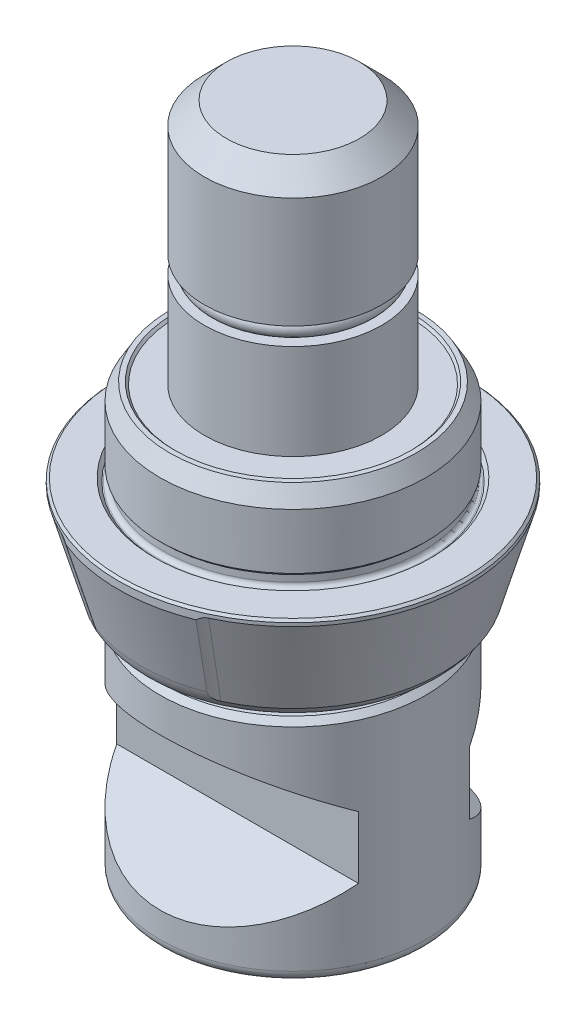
ISO-10303-21;
HEADER;
FILE_DESCRIPTION(('STEP AP214'),'2;1');
FILE_NAME('part.step','',(''),(''),'','','');
FILE_SCHEMA(('AUTOMOTIVE_DESIGN { 1 0 10303 214 1 1 1 1 }'));
ENDSEC;
DATA;
#1=APPLICATION_CONTEXT('core data for automotive mechanical design processes');
#2=APPLICATION_PROTOCOL_DEFINITION('international standard','automotive_design',2000,#1);
#3=PRODUCT_CONTEXT('',#1,'mechanical');
#4=PRODUCT('Part','Part','',(#3));
#5=PRODUCT_RELATED_PRODUCT_CATEGORY('part','',(#4));
#6=PRODUCT_DEFINITION_FORMATION('','',#4);
#7=PRODUCT_DEFINITION_CONTEXT('part definition',#1,'design');
#8=PRODUCT_DEFINITION('design','',#6,#7);
#9=PRODUCT_DEFINITION_SHAPE('','',#8);
#10=(LENGTH_UNIT() NAMED_UNIT(*) SI_UNIT(.MILLI.,.METRE.));
#11=(NAMED_UNIT(*) PLANE_ANGLE_UNIT() SI_UNIT($,.RADIAN.));
#12=(NAMED_UNIT(*) SI_UNIT($,.STERADIAN.) SOLID_ANGLE_UNIT());
#13=UNCERTAINTY_MEASURE_WITH_UNIT(LENGTH_MEASURE(1.E-05),#10,'distance_accuracy_value','');
#14=(GEOMETRIC_REPRESENTATION_CONTEXT(3) GLOBAL_UNCERTAINTY_ASSIGNED_CONTEXT((#13)) GLOBAL_UNIT_ASSIGNED_CONTEXT((#10,
#11,#12)) REPRESENTATION_CONTEXT('',''));
#15=CARTESIAN_POINT('',(0.,0.,0.));
#16=DIRECTION('',(0.,0.,1.));
#17=DIRECTION('',(1.,0.,0.));
#18=AXIS2_PLACEMENT_3D('',#15,#16,#17);
#19=CARTESIAN_POINT('',(0.,-9.9,0.));
#20=DIRECTION('',(0.,1.,0.));
#21=DIRECTION('',(0.,0.,-1.));
#22=AXIS2_PLACEMENT_3D('',#19,#20,#21);
#23=TOROIDAL_SURFACE('',#22,8.6,0.6);
#24=CARTESIAN_POINT('',(0.,-10.5,0.));
#25=DIRECTION('',(0.,1.,0.));
#26=DIRECTION('',(0.,0.,-1.));
#27=AXIS2_PLACEMENT_3D('',#24,#25,#26);
#28=CIRCLE('',#27,8.6);
#29=CARTESIAN_POINT('',(0.,-10.5,-8.6));
#30=VERTEX_POINT('',#29);
#31=EDGE_CURVE('E445',#30,#30,#28,.F.);
#32=ORIENTED_EDGE('',*,*,#31,.F.);
#33=EDGE_LOOP('',(#32));
#34=FACE_BOUND('',#33,.T.);
#35=CARTESIAN_POINT('',(0.,-10.,0.));
#36=DIRECTION('',(0.,-1.,0.));
#37=DIRECTION('',(0.,0.,-1.));
#38=AXIS2_PLACEMENT_3D('',#35,#36,#37);
#39=CIRCLE('',#38,8.00839202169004);
#40=CARTESIAN_POINT('',(0.,-10.,-8.00839202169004));
#41=VERTEX_POINT('',#40);
#42=EDGE_CURVE('E10',#41,#41,#39,.F.);
#43=ORIENTED_EDGE('',*,*,#42,.F.);
#44=EDGE_LOOP('',(#43));
#45=FACE_BOUND('',#44,.T.);
#46=ADVANCED_FACE('F16',(#34,#45),#23,.F.);
#47=CARTESIAN_POINT('',(-12.,-31.1,15.));
#48=DIRECTION('',(0.,1.,0.));
#49=DIRECTION('',(1.,0.,0.));
#50=AXIS2_PLACEMENT_3D('',#47,#48,#49);
#51=PLANE('',#50);
#52=CARTESIAN_POINT('',(0.,-31.1,0.));
#53=DIRECTION('',(0.,1.,0.));
#54=DIRECTION('',(0.,0.,-1.));
#55=AXIS2_PLACEMENT_3D('',#52,#53,#54);
#56=CIRCLE('',#55,3.75);
#57=CARTESIAN_POINT('',(0.,-31.1,-3.75));
#58=VERTEX_POINT('',#57);
#59=EDGE_CURVE('E384',#58,#58,#56,.T.);
#60=ORIENTED_EDGE('',*,*,#59,.T.);
#61=EDGE_LOOP('',(#60));
#62=FACE_BOUND('',#61,.T.);
#63=CARTESIAN_POINT('',(0.,-31.1,0.));
#64=DIRECTION('',(0.,1.,0.));
#65=DIRECTION('',(1.,0.,0.));
#66=AXIS2_PLACEMENT_3D('',#63,#64,#65);
#67=CIRCLE('',#66,11.);
#68=CARTESIAN_POINT('',(11.,-31.1,0.));
#69=VERTEX_POINT('',#68);
#70=EDGE_CURVE('E367',#69,#69,#67,.F.);
#71=ORIENTED_EDGE('',*,*,#70,.T.);
#72=EDGE_LOOP('',(#71));
#73=FACE_BOUND('',#72,.T.);
#74=ADVANCED_FACE('F296',(#62,#73),#51,.F.);
#75=CARTESIAN_POINT('',(25.,-14.1,12.));
#76=DIRECTION('',(0.,0.866025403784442,-0.499999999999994));
#77=DIRECTION('',(0.,-0.499999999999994,-0.866025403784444));
#78=AXIS2_PLACEMENT_3D('',#75,#76,#77);
#79=PLANE('',#78);
#80=DIRECTION('',(-1.,0.,0.));
#81=VECTOR('',#80,1.);
#82=CARTESIAN_POINT('',(25.,-18.1414518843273,5.));
#83=LINE('',#82,#81);
#84=CARTESIAN_POINT('',(10.9087121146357,-18.1414518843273,5.));
#85=VERTEX_POINT('',#84);
#86=CARTESIAN_POINT('',(-10.9087121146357,-18.1414518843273,5.));
#87=VERTEX_POINT('',#86);
#88=EDGE_CURVE('E37',#85,#87,#83,.T.);
#89=ORIENTED_EDGE('',*,*,#88,.F.);
#90=CARTESIAN_POINT('',(0.,-21.0282032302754,0.));
#91=DIRECTION('',(0.,0.866025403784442,-0.499999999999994));
#92=DIRECTION('',(0.,0.499999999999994,0.866025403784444));
#93=AXIS2_PLACEMENT_3D('',#90,#91,#92);
#94=ELLIPSE('',#93,13.856406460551,12.);
#95=EDGE_CURVE('E448',#87,#85,#94,.T.);
#96=ORIENTED_EDGE('',*,*,#95,.F.);
#97=EDGE_LOOP('',(#89,#96));
#98=FACE_BOUND('',#97,.T.);
#99=ADVANCED_FACE('F299',(#98),#79,.F.);
#100=CARTESIAN_POINT('',(25.,-26.9339745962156,10.5));
#101=DIRECTION('',(0.,-0.866025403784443,-0.499999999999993));
#102=DIRECTION('',(0.,-0.499999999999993,0.866025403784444));
#103=AXIS2_PLACEMENT_3D('',#100,#101,#102);
#104=PLANE('',#103);
#105=CARTESIAN_POINT('',(0.,-20.8717967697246,0.));
#106=DIRECTION('',(0.,-0.866025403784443,-0.499999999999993));
#107=DIRECTION('',(0.,0.499999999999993,-0.866025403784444));
#108=AXIS2_PLACEMENT_3D('',#105,#106,#107);
#109=ELLIPSE('',#108,13.856406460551,12.);
#110=CARTESIAN_POINT('',(10.9087121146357,-23.7585481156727,5.));
#111=VERTEX_POINT('',#110);
#112=CARTESIAN_POINT('',(-10.9087121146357,-23.7585481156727,5.));
#113=VERTEX_POINT('',#112);
#114=EDGE_CURVE('E453',#111,#113,#109,.T.);
#115=ORIENTED_EDGE('',*,*,#114,.F.);
#116=DIRECTION('',(-1.,0.,0.));
#117=VECTOR('',#116,1.);
#118=CARTESIAN_POINT('',(25.,-23.7585481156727,5.));
#119=LINE('',#118,#117);
#120=EDGE_CURVE('E30',#111,#113,#119,.T.);
#121=ORIENTED_EDGE('',*,*,#120,.T.);
#122=EDGE_LOOP('',(#115,#121));
#123=FACE_BOUND('',#122,.T.);
#124=ADVANCED_FACE('F314',(#123),#104,.F.);
#125=CARTESIAN_POINT('',(25.,-18.1414518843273,5.));
#126=DIRECTION('',(0.,0.,-1.));
#127=DIRECTION('',(-1.,0.,0.));
#128=AXIS2_PLACEMENT_3D('',#125,#126,#127);
#129=PLANE('',#128);
#130=DIRECTION('',(0.,1.,0.));
#131=VECTOR('',#130,1.);
#132=CARTESIAN_POINT('',(10.9087121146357,-31.1,5.));
#133=LINE('',#132,#131);
#134=EDGE_CURVE('E421',#85,#111,#133,.F.);
#135=ORIENTED_EDGE('',*,*,#134,.F.);
#136=ORIENTED_EDGE('',*,*,#88,.T.);
#137=DIRECTION('',(0.,1.,0.));
#138=VECTOR('',#137,1.);
#139=CARTESIAN_POINT('',(-10.9087121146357,-51.5,5.));
#140=LINE('',#139,#138);
#141=EDGE_CURVE('E450',#113,#87,#140,.T.);
#142=ORIENTED_EDGE('',*,*,#141,.F.);
#143=ORIENTED_EDGE('',*,*,#120,.F.);
#144=EDGE_LOOP('',(#135,#136,#142,#143));
#145=FACE_BOUND('',#144,.T.);
#146=ADVANCED_FACE('F305',(#145),#129,.F.);
#147=CARTESIAN_POINT('',(25.,-14.1,-12.));
#148=DIRECTION('',(0.,-0.866025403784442,-0.499999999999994));
#149=DIRECTION('',(0.,-0.499999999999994,0.866025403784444));
#150=AXIS2_PLACEMENT_3D('',#147,#148,#149);
#151=PLANE('',#150);
#152=CARTESIAN_POINT('',(0.,-21.0282032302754,0.));
#153=DIRECTION('',(0.,-0.866025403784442,-0.499999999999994));
#154=DIRECTION('',(0.,0.499999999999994,-0.866025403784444));
#155=AXIS2_PLACEMENT_3D('',#152,#153,#154);
#156=ELLIPSE('',#155,13.856406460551,12.);
#157=CARTESIAN_POINT('',(-10.9087121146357,-18.1414518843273,-5.));
#158=VERTEX_POINT('',#157);
#159=CARTESIAN_POINT('',(10.9087121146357,-18.1414518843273,-5.));
#160=VERTEX_POINT('',#159);
#161=EDGE_CURVE('E358',#158,#160,#156,.T.);
#162=ORIENTED_EDGE('',*,*,#161,.T.);
#163=DIRECTION('',(-1.,0.,0.));
#164=VECTOR('',#163,1.);
#165=CARTESIAN_POINT('',(25.,-18.1414518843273,-5.));
#166=LINE('',#165,#164);
#167=EDGE_CURVE('E434',#160,#158,#166,.T.);
#168=ORIENTED_EDGE('',*,*,#167,.T.);
#169=EDGE_LOOP('',(#162,#168));
#170=FACE_BOUND('',#169,.T.);
#171=ADVANCED_FACE('F301',(#170),#151,.T.);
#172=CARTESIAN_POINT('',(25.,-18.1414518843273,-5.));
#173=DIRECTION('',(0.,0.,-1.));
#174=DIRECTION('',(-1.,0.,0.));
#175=AXIS2_PLACEMENT_3D('',#172,#173,#174);
#176=PLANE('',#175);
#177=ORIENTED_EDGE('',*,*,#167,.F.);
#178=DIRECTION('',(0.,1.,0.));
#179=VECTOR('',#178,1.);
#180=CARTESIAN_POINT('',(10.9087121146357,-31.1,-5.));
#181=LINE('',#180,#179);
#182=CARTESIAN_POINT('',(10.9087121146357,-23.7585481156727,-5.));
#183=VERTEX_POINT('',#182);
#184=EDGE_CURVE('E418',#160,#183,#181,.F.);
#185=ORIENTED_EDGE('',*,*,#184,.T.);
#186=DIRECTION('',(-1.,0.,0.));
#187=VECTOR('',#186,1.);
#188=CARTESIAN_POINT('',(25.,-23.7585481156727,-5.));
#189=LINE('',#188,#187);
#190=CARTESIAN_POINT('',(-10.9087121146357,-23.7585481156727,-5.));
#191=VERTEX_POINT('',#190);
#192=EDGE_CURVE('E433',#183,#191,#189,.T.);
#193=ORIENTED_EDGE('',*,*,#192,.T.);
#194=DIRECTION('',(0.,1.,0.));
#195=VECTOR('',#194,1.);
#196=CARTESIAN_POINT('',(-10.9087121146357,-51.5,-5.));
#197=LINE('',#196,#195);
#198=EDGE_CURVE('E362',#191,#158,#197,.T.);
#199=ORIENTED_EDGE('',*,*,#198,.T.);
#200=EDGE_LOOP('',(#177,#185,#193,#199));
#201=FACE_BOUND('',#200,.T.);
#202=ADVANCED_FACE('F304',(#201),#176,.T.);
#203=CARTESIAN_POINT('',(25.,-23.7585481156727,-5.));
#204=DIRECTION('',(0.,0.866025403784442,-0.5));
#205=DIRECTION('',(0.,-0.499999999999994,-0.866025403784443));
#206=AXIS2_PLACEMENT_3D('',#203,#204,#205);
#207=PLANE('',#206);
#208=ORIENTED_EDGE('',*,*,#192,.F.);
#209=CARTESIAN_POINT('',(0.,-20.8717967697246,0.));
#210=DIRECTION('',(0.,0.866025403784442,-0.5));
#211=DIRECTION('',(0.,0.499999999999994,0.866025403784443));
#212=AXIS2_PLACEMENT_3D('',#209,#210,#211);
#213=ELLIPSE('',#212,13.856406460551,12.);
#214=EDGE_CURVE('E456',#183,#191,#213,.T.);
#215=ORIENTED_EDGE('',*,*,#214,.T.);
#216=EDGE_LOOP('',(#208,#215));
#217=FACE_BOUND('',#216,.T.);
#218=ADVANCED_FACE('F309',(#217),#207,.T.);
#219=CARTESIAN_POINT('',(0.,-30.1,0.));
#220=DIRECTION('',(0.,1.,0.));
#221=DIRECTION('',(1.,0.,0.));
#222=AXIS2_PLACEMENT_3D('',#219,#220,#221);
#223=TOROIDAL_SURFACE('',#222,11.,1.);
#224=ORIENTED_EDGE('',*,*,#70,.F.);
#225=EDGE_LOOP('',(#224));
#226=FACE_BOUND('',#225,.T.);
#227=CARTESIAN_POINT('',(0.,-30.1,0.));
#228=DIRECTION('',(0.,1.,0.));
#229=DIRECTION('',(1.,0.,0.));
#230=AXIS2_PLACEMENT_3D('',#227,#228,#229);
#231=CIRCLE('',#230,12.);
#232=CARTESIAN_POINT('',(12.,-30.1,0.));
#233=VERTEX_POINT('',#232);
#234=EDGE_CURVE('E360',#233,#233,#231,.T.);
#235=ORIENTED_EDGE('',*,*,#234,.F.);
#236=EDGE_LOOP('',(#235));
#237=FACE_BOUND('',#236,.T.);
#238=ADVANCED_FACE('F18',(#226,#237),#223,.T.);
#239=CARTESIAN_POINT('',(0.,-51.5,0.));
#240=DIRECTION('',(0.,1.,0.));
#241=DIRECTION('',(0.,0.,-1.));
#242=AXIS2_PLACEMENT_3D('',#239,#240,#241);
#243=CYLINDRICAL_SURFACE('',#242,12.);
#244=ORIENTED_EDGE('',*,*,#234,.T.);
#245=EDGE_LOOP('',(#244));
#246=FACE_BOUND('',#245,.T.);
#247=CARTESIAN_POINT('',(0.,-11.,0.));
#248=DIRECTION('',(0.,1.,0.));
#249=DIRECTION('',(0.,0.,-1.));
#250=AXIS2_PLACEMENT_3D('',#247,#248,#249);
#251=CIRCLE('',#250,12.);
#252=CARTESIAN_POINT('',(0.,-11.,-12.));
#253=VERTEX_POINT('',#252);
#254=EDGE_CURVE('E356',#253,#253,#251,.F.);
#255=ORIENTED_EDGE('',*,*,#254,.T.);
#256=EDGE_LOOP('',(#255));
#257=FACE_BOUND('',#256,.T.);
#258=ORIENTED_EDGE('',*,*,#214,.F.);
#259=ORIENTED_EDGE('',*,*,#184,.F.);
#260=ORIENTED_EDGE('',*,*,#161,.F.);
#261=ORIENTED_EDGE('',*,*,#198,.F.);
#262=EDGE_LOOP('',(#258,#259,#260,#261));
#263=FACE_BOUND('',#262,.T.);
#264=ORIENTED_EDGE('',*,*,#134,.T.);
#265=ORIENTED_EDGE('',*,*,#114,.T.);
#266=ORIENTED_EDGE('',*,*,#141,.T.);
#267=ORIENTED_EDGE('',*,*,#95,.T.);
#268=EDGE_LOOP('',(#264,#265,#266,#267));
#269=FACE_BOUND('',#268,.T.);
#270=ADVANCED_FACE('F322',(#246,#257,#263,#269),#243,.T.);
#271=CARTESIAN_POINT('',(0.,-11.,0.));
#272=DIRECTION('',(0.,-1.,0.));
#273=DIRECTION('',(0.,0.,1.));
#274=AXIS2_PLACEMENT_3D('',#271,#272,#273);
#275=CONICAL_SURFACE('',#274,12.,0.785398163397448);
#276=CARTESIAN_POINT('',(0.,-10.5,0.));
#277=DIRECTION('',(0.,1.,0.));
#278=DIRECTION('',(0.,0.,-1.));
#279=AXIS2_PLACEMENT_3D('',#276,#277,#278);
#280=CIRCLE('',#279,11.5);
#281=CARTESIAN_POINT('',(0.,-10.5,-11.5));
#282=VERTEX_POINT('',#281);
#283=EDGE_CURVE('E353',#282,#282,#280,.T.);
#284=ORIENTED_EDGE('',*,*,#283,.F.);
#285=EDGE_LOOP('',(#284));
#286=FACE_BOUND('',#285,.T.);
#287=ORIENTED_EDGE('',*,*,#254,.F.);
#288=EDGE_LOOP('',(#287));
#289=FACE_BOUND('',#288,.T.);
#290=ADVANCED_FACE('F325',(#286,#289),#275,.T.);
#291=CARTESIAN_POINT('',(0.,-10.5,0.));
#292=DIRECTION('',(0.,1.,0.));
#293=DIRECTION('',(0.,0.,-1.));
#294=AXIS2_PLACEMENT_3D('',#291,#292,#293);
#295=PLANE('',#294);
#296=ORIENTED_EDGE('',*,*,#283,.T.);
#297=EDGE_LOOP('',(#296));
#298=FACE_BOUND('',#297,.T.);
#299=ORIENTED_EDGE('',*,*,#31,.T.);
#300=EDGE_LOOP('',(#299));
#301=FACE_BOUND('',#300,.T.);
#302=ADVANCED_FACE('F207',(#298,#301),#295,.T.);
#303=CARTESIAN_POINT('',(0.,-31.1,0.));
#304=DIRECTION('',(0.,-1.,0.));
#305=DIRECTION('',(0.,0.,1.));
#306=AXIS2_PLACEMENT_3D('',#303,#304,#305);
#307=CONICAL_SURFACE('',#306,3.75,1.0471975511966);
#308=ORIENTED_EDGE('',*,*,#59,.F.);
#309=EDGE_LOOP('',(#308));
#310=FACE_BOUND('',#309,.T.);
#311=CARTESIAN_POINT('',(-0.000200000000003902,-30.9350031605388,3.4642170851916));
#312=CARTESIAN_POINT('',(0.131635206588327,-30.8910410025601,3.38810199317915));
#313=CARTESIAN_POINT('',(0.264608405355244,-30.8510588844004,3.31132988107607));
#314=CARTESIAN_POINT('',(0.53285742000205,-30.7812693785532,3.15645624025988));
#315=CARTESIAN_POINT('',(0.668138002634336,-30.7514866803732,3.078351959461));
#316=CARTESIAN_POINT('',(0.937022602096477,-30.705125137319,2.92311136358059));
#317=CARTESIAN_POINT('',(1.07058524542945,-30.6882377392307,2.84599893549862));
#318=CARTESIAN_POINT('',(1.33833905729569,-30.6680769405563,2.6914112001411));
#319=CARTESIAN_POINT('',(1.47252925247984,-30.6647868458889,2.61393645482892));
#320=CARTESIAN_POINT('',(1.72327559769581,-30.6716278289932,2.46916798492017));
#321=CARTESIAN_POINT('',(1.83986926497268,-30.6800792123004,2.40185259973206));
#322=CARTESIAN_POINT('',(2.07229698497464,-30.7068662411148,2.2676603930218));
#323=CARTESIAN_POINT('',(2.18813023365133,-30.7252110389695,2.2007840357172));
#324=CARTESIAN_POINT('',(2.42103725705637,-30.7710720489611,2.06631510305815));
#325=CARTESIAN_POINT('',(2.53808155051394,-30.7987826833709,1.99873954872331));
#326=CARTESIAN_POINT('',(2.77042435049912,-30.8616750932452,1.86459637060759));
#327=CARTESIAN_POINT('',(2.88572583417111,-30.8968420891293,1.79802702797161));
#328=CARTESIAN_POINT('',(3.0002,-30.9350031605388,1.73193533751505));
#329=B_SPLINE_CURVE_WITH_KNOTS('',3,(#311,#312,#313,#314,#315,#316,#317,#318,#319,#320,#321,
#322,#323,#324,#325,#326,#327,#328),.UNSPECIFIED.,.F.,.F.,(4,2,2,2,2,2,2,2,4),(0.,
0.475539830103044,0.952222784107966,1.41710776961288,1.88142182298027,2.28572436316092,
2.6904015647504,3.10405572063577,3.51689749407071),.UNSPECIFIED.);
#330=CARTESIAN_POINT('',(0.,-30.9349364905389,3.46410161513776));
#331=VERTEX_POINT('',#330);
#332=CARTESIAN_POINT('',(3.,-30.9349364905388,1.73205080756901));
#333=VERTEX_POINT('',#332);
#334=EDGE_CURVE('E252',#331,#333,#329,.T.);
#335=ORIENTED_EDGE('',*,*,#334,.T.);
#336=CARTESIAN_POINT('',(3.,-32.4126261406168,5.22331081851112));
#337=CARTESIAN_POINT('',(3.,-32.3500953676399,5.09839207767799));
#338=CARTESIAN_POINT('',(3.,-32.2879936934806,4.97325627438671));
#339=CARTESIAN_POINT('',(3.,-32.1648581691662,4.72245581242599));
#340=CARTESIAN_POINT('',(3.,-32.1038243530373,4.59679113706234));
#341=CARTESIAN_POINT('',(3.,-31.9829170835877,4.3445935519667));
#342=CARTESIAN_POINT('',(3.,-31.9230462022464,4.21805940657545));
#343=CARTESIAN_POINT('',(3.,-31.8048773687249,3.96425506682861));
#344=CARTESIAN_POINT('',(3.,-31.7465794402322,3.83698486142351));
#345=CARTESIAN_POINT('',(3.,-31.6293314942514,3.57579973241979));
#346=CARTESIAN_POINT('',(3.,-31.5704710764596,3.44184445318));
#347=CARTESIAN_POINT('',(3.,-31.4554163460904,3.17279497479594));
#348=CARTESIAN_POINT('',(3.,-31.3992219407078,3.03770081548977));
#349=CARTESIAN_POINT('',(3.,-31.2902586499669,2.76625064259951));
#350=CARTESIAN_POINT('',(3.,-31.237487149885,2.62989568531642));
#351=CARTESIAN_POINT('',(3.,-31.1362580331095,2.35554255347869));
#352=CARTESIAN_POINT('',(3.,-31.0878016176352,2.21754393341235));
#353=CARTESIAN_POINT('',(3.,-30.9858075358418,1.90736941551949));
#354=CARTESIAN_POINT('',(3.,-30.9337102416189,1.73471109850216));
#355=CARTESIAN_POINT('',(3.,-30.8409165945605,1.38639576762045));
#356=CARTESIAN_POINT('',(3.,-30.8002135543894,1.21074057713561));
#357=CARTESIAN_POINT('',(3.,-30.7341754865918,0.85953586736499));
#358=CARTESIAN_POINT('',(3.,-30.7085934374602,0.684034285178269));
#359=CARTESIAN_POINT('',(3.,-30.6746384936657,0.331383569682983));
#360=CARTESIAN_POINT('',(3.,-30.6662581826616,0.154235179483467));
#361=CARTESIAN_POINT('',(3.,-30.6678218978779,-0.201072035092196));
#362=CARTESIAN_POINT('',(3.,-30.6778793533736,-0.379230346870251));
#363=CARTESIAN_POINT('',(3.,-30.7151890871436,-0.733747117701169));
#364=CARTESIAN_POINT('',(3.,-30.7424494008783,-0.910104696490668));
#365=CARTESIAN_POINT('',(3.,-30.811721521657,-1.26294952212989));
#366=CARTESIAN_POINT('',(3.,-30.8539781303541,-1.43938719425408));
#367=CARTESIAN_POINT('',(3.,-30.9496812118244,-1.78923874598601));
#368=CARTESIAN_POINT('',(3.,-31.0031340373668,-1.96265084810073));
#369=CARTESIAN_POINT('',(3.,-31.1063214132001,-2.27091047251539));
#370=CARTESIAN_POINT('',(3.,-31.1545194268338,-2.40628172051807));
#371=CARTESIAN_POINT('',(3.,-31.2549625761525,-2.67546504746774));
#372=CARTESIAN_POINT('',(3.,-31.3072065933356,-2.80927754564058));
#373=CARTESIAN_POINT('',(3.,-31.4149156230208,-3.07570061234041));
#374=CARTESIAN_POINT('',(3.,-31.4703828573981,-3.20831027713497));
#375=CARTESIAN_POINT('',(3.,-31.5838418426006,-3.47244628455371));
#376=CARTESIAN_POINT('',(3.,-31.6418336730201,-3.60397259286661));
#377=CARTESIAN_POINT('',(3.,-31.7573189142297,-3.86053084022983));
#378=CARTESIAN_POINT('',(3.,-31.8147282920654,-3.98560072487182));
#379=CARTESIAN_POINT('',(3.,-31.9310518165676,-4.23503512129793));
#380=CARTESIAN_POINT('',(3.,-31.9899659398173,-4.35939964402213));
#381=CARTESIAN_POINT('',(3.,-32.1089223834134,-4.60731081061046));
#382=CARTESIAN_POINT('',(3.,-32.1689624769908,-4.73085852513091));
#383=CARTESIAN_POINT('',(3.,-32.2900719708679,-4.97744444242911));
#384=CARTESIAN_POINT('',(3.,-32.3511413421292,-5.10048265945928));
#385=CARTESIAN_POINT('',(3.,-32.4126261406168,-5.22331081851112));
#386=B_SPLINE_CURVE_WITH_KNOTS('',3,(#336,#337,#338,#339,#340,#341,#342,#343,#344,#345,#346,
#347,#348,#349,#350,#351,#352,#353,#354,#355,#356,#357,#358,#359,#360,#361,#362,#363,#364,#365,
#366,#367,#368,#369,#370,#371,#372,#373,#374,#375,#376,#377,#378,#379,#380,#381,#382,#383,#384,
#385),.UNSPECIFIED.,.F.,.F.,(4,2,2,2,2,2,2,2,2,2,2,2,2,2,2,2,2,2,2,2,2,2,2,2,4),(0.,
0.419088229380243,0.838189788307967,1.25813167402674,1.67807988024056,2.11700693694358,
2.55591870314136,2.99449114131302,3.43318528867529,3.97393590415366,4.51436848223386,
5.04570917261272,5.57682073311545,6.11121066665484,6.64585039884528,7.18965267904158,
7.73376435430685,8.16477855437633,8.59567402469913,9.02687013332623,9.45807984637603,
9.87091765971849,10.2837490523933,10.6958357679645,11.1079108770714),.UNSPECIFIED.);
#387=CARTESIAN_POINT('',(3.,-30.9349364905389,-1.73205080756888));
#388=VERTEX_POINT('',#387);
#389=EDGE_CURVE('E247',#333,#388,#386,.T.);
#390=ORIENTED_EDGE('',*,*,#389,.T.);
#391=CARTESIAN_POINT('',(3.0002,-30.9350031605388,-1.73193533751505));
#392=CARTESIAN_POINT('',(2.86836479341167,-30.8910410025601,-1.80805042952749));
#393=CARTESIAN_POINT('',(2.73539159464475,-30.8510588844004,-1.88482254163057));
#394=CARTESIAN_POINT('',(2.46714257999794,-30.7812693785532,-2.03969618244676));
#395=CARTESIAN_POINT('',(2.33186199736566,-30.7514866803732,-2.11780046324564));
#396=CARTESIAN_POINT('',(2.06297739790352,-30.705125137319,-2.27304105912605));
#397=CARTESIAN_POINT('',(1.92941475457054,-30.6882377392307,-2.35015348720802));
#398=CARTESIAN_POINT('',(1.66166094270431,-30.6680769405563,-2.50474122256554));
#399=CARTESIAN_POINT('',(1.52747074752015,-30.6647868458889,-2.58221596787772));
#400=CARTESIAN_POINT('',(1.27672440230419,-30.6716278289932,-2.72698443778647));
#401=CARTESIAN_POINT('',(1.16013073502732,-30.6800792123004,-2.79429982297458));
#402=CARTESIAN_POINT('',(0.927703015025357,-30.7068662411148,-2.92849202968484));
#403=CARTESIAN_POINT('',(0.811869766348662,-30.7252110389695,-2.99536838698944));
#404=CARTESIAN_POINT('',(0.578962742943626,-30.7710720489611,-3.12983731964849));
#405=CARTESIAN_POINT('',(0.461918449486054,-30.7987826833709,-3.19741287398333));
#406=CARTESIAN_POINT('',(0.229575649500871,-30.8616750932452,-3.33155605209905));
#407=CARTESIAN_POINT('',(0.11427416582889,-30.8968420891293,-3.39812539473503));
#408=CARTESIAN_POINT('',(-0.000200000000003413,-30.9350031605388,-3.4642170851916));
#409=B_SPLINE_CURVE_WITH_KNOTS('',3,(#391,#392,#393,#394,#395,#396,#397,#398,#399,#400,#401,
#402,#403,#404,#405,#406,#407,#408),.UNSPECIFIED.,.F.,.F.,(4,2,2,2,2,2,2,2,4),(0.,
0.475539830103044,0.952222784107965,1.41710776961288,1.88142182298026,2.28572436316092,
2.6904015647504,3.10405572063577,3.51689749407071),.UNSPECIFIED.);
#410=CARTESIAN_POINT('',(0.,-30.9349364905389,-3.46410161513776));
#411=VERTEX_POINT('',#410);
#412=EDGE_CURVE('E240',#388,#411,#409,.T.);
#413=ORIENTED_EDGE('',*,*,#412,.T.);
#414=CARTESIAN_POINT('',(0.000199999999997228,-30.9350031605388,-3.4642170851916));
#415=CARTESIAN_POINT('',(-0.131635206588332,-30.8910410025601,-3.38810199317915));
#416=CARTESIAN_POINT('',(-0.264608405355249,-30.8510588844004,-3.31132988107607));
#417=CARTESIAN_POINT('',(-0.532857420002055,-30.7812693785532,-3.15645624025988));
#418=CARTESIAN_POINT('',(-0.66813800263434,-30.7514866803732,-3.078351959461));
#419=CARTESIAN_POINT('',(-0.937022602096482,-30.705125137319,-2.92311136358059));
#420=CARTESIAN_POINT('',(-1.07058524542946,-30.6882377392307,-2.84599893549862));
#421=CARTESIAN_POINT('',(-1.33833905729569,-30.6680769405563,-2.6914112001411));
#422=CARTESIAN_POINT('',(-1.47252925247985,-30.6647868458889,-2.61393645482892));
#423=CARTESIAN_POINT('',(-1.72327559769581,-30.6716278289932,-2.46916798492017));
#424=CARTESIAN_POINT('',(-1.83986926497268,-30.6800792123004,-2.40185259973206));
#425=CARTESIAN_POINT('',(-2.07229698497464,-30.7068662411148,-2.2676603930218));
#426=CARTESIAN_POINT('',(-2.18813023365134,-30.7252110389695,-2.2007840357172));
#427=CARTESIAN_POINT('',(-2.42103725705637,-30.7710720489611,-2.06631510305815));
#428=CARTESIAN_POINT('',(-2.53808155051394,-30.7987826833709,-1.99873954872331));
#429=CARTESIAN_POINT('',(-2.77042435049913,-30.8616750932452,-1.86459637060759));
#430=CARTESIAN_POINT('',(-2.88572583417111,-30.8968420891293,-1.79802702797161));
#431=CARTESIAN_POINT('',(-3.0002,-30.9350031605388,-1.73193533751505));
#432=B_SPLINE_CURVE_WITH_KNOTS('',3,(#414,#415,#416,#417,#418,#419,#420,#421,#422,#423,#424,
#425,#426,#427,#428,#429,#430,#431),.UNSPECIFIED.,.F.,.F.,(4,2,2,2,2,2,2,2,4),(0.,
0.475539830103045,0.952222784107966,1.41710776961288,1.88142182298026,2.28572436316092,
2.69040156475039,3.10405572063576,3.5168974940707),.UNSPECIFIED.);
#433=CARTESIAN_POINT('',(-3.,-30.9349364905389,-1.73205080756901));
#434=VERTEX_POINT('',#433);
#435=EDGE_CURVE('E233',#411,#434,#432,.T.);
#436=ORIENTED_EDGE('',*,*,#435,.T.);
#437=CARTESIAN_POINT('',(-3.,-32.4126261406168,-5.22331081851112));
#438=CARTESIAN_POINT('',(-3.,-32.3500953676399,-5.09839207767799));
#439=CARTESIAN_POINT('',(-3.,-32.2879936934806,-4.97325627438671));
#440=CARTESIAN_POINT('',(-3.,-32.1648581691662,-4.722455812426));
#441=CARTESIAN_POINT('',(-3.,-32.1038243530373,-4.59679113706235));
#442=CARTESIAN_POINT('',(-3.,-31.9829170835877,-4.3445935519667));
#443=CARTESIAN_POINT('',(-3.,-31.9230462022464,-4.21805940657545));
#444=CARTESIAN_POINT('',(-3.,-31.8048773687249,-3.96425506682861));
#445=CARTESIAN_POINT('',(-3.,-31.7465794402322,-3.83698486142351));
#446=CARTESIAN_POINT('',(-3.,-31.6293314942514,-3.57579973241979));
#447=CARTESIAN_POINT('',(-3.,-31.5704710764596,-3.44184445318));
#448=CARTESIAN_POINT('',(-3.,-31.4554163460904,-3.17279497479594));
#449=CARTESIAN_POINT('',(-3.,-31.3992219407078,-3.03770081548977));
#450=CARTESIAN_POINT('',(-3.,-31.2902586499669,-2.76625064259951));
#451=CARTESIAN_POINT('',(-3.,-31.237487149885,-2.62989568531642));
#452=CARTESIAN_POINT('',(-3.,-31.1362580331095,-2.35554255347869));
#453=CARTESIAN_POINT('',(-3.,-31.0878016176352,-2.21754393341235));
#454=CARTESIAN_POINT('',(-3.,-30.9858075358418,-1.90736941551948));
#455=CARTESIAN_POINT('',(-3.,-30.9337102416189,-1.73471109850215));
#456=CARTESIAN_POINT('',(-3.,-30.8409165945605,-1.38639576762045));
#457=CARTESIAN_POINT('',(-3.,-30.8002135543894,-1.2107405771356));
#458=CARTESIAN_POINT('',(-3.,-30.7341754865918,-0.859535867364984));
#459=CARTESIAN_POINT('',(-3.,-30.7085934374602,-0.684034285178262));
#460=CARTESIAN_POINT('',(-3.,-30.6746384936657,-0.331383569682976));
#461=CARTESIAN_POINT('',(-3.,-30.6662581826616,-0.15423517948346));
#462=CARTESIAN_POINT('',(-3.,-30.6678218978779,0.201072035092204));
#463=CARTESIAN_POINT('',(-3.,-30.6778793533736,0.379230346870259));
#464=CARTESIAN_POINT('',(-3.,-30.7151890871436,0.733747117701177));
#465=CARTESIAN_POINT('',(-3.,-30.7424494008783,0.910104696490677));
#466=CARTESIAN_POINT('',(-3.,-30.811721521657,1.2629495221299));
#467=CARTESIAN_POINT('',(-3.,-30.8539781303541,1.43938719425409));
#468=CARTESIAN_POINT('',(-3.,-30.9496812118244,1.78923874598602));
#469=CARTESIAN_POINT('',(-3.,-31.0031340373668,1.96265084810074));
#470=CARTESIAN_POINT('',(-3.,-31.1063214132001,2.2709104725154));
#471=CARTESIAN_POINT('',(-3.,-31.1545194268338,2.40628172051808));
#472=CARTESIAN_POINT('',(-3.,-31.2549625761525,2.67546504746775));
#473=CARTESIAN_POINT('',(-3.,-31.3072065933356,2.80927754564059));
#474=CARTESIAN_POINT('',(-3.,-31.4149156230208,3.07570061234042));
#475=CARTESIAN_POINT('',(-3.,-31.4703828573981,3.20831027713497));
#476=CARTESIAN_POINT('',(-3.,-31.5838418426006,3.47244628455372));
#477=CARTESIAN_POINT('',(-3.,-31.6418336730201,3.60397259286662));
#478=CARTESIAN_POINT('',(-3.,-31.7573189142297,3.86053084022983));
#479=CARTESIAN_POINT('',(-3.,-31.8147282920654,3.98560072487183));
#480=CARTESIAN_POINT('',(-3.,-31.9310518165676,4.23503512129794));
#481=CARTESIAN_POINT('',(-3.,-31.9899659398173,4.35939964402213));
#482=CARTESIAN_POINT('',(-3.,-32.1089223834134,4.60731081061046));
#483=CARTESIAN_POINT('',(-3.,-32.1689624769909,4.73085852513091));
#484=CARTESIAN_POINT('',(-3.,-32.2900719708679,4.97744444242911));
#485=CARTESIAN_POINT('',(-3.,-32.3511413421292,5.10048265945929));
#486=CARTESIAN_POINT('',(-3.,-32.4126261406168,5.22331081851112));
#487=B_SPLINE_CURVE_WITH_KNOTS('',3,(#437,#438,#439,#440,#441,#442,#443,#444,#445,#446,#447,
#448,#449,#450,#451,#452,#453,#454,#455,#456,#457,#458,#459,#460,#461,#462,#463,#464,#465,#466,
#467,#468,#469,#470,#471,#472,#473,#474,#475,#476,#477,#478,#479,#480,#481,#482,#483,#484,#485,
#486),.UNSPECIFIED.,.F.,.F.,(4,2,2,2,2,2,2,2,2,2,2,2,2,2,2,2,2,2,2,2,2,2,2,2,4),(0.,
0.419088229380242,0.838189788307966,1.25813167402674,1.67807988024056,2.11700693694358,
2.55591870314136,2.99449114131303,3.4331852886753,3.97393590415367,4.51436848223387,
5.04570917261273,5.57682073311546,6.11121066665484,6.64585039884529,7.18965267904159,
7.73376435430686,8.16477855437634,8.59567402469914,9.02687013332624,9.45807984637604,
9.8709176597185,10.2837490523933,10.6958357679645,11.1079108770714),.UNSPECIFIED.);
#488=CARTESIAN_POINT('',(-3.,-30.9349364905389,1.73205080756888));
#489=VERTEX_POINT('',#488);
#490=EDGE_CURVE('E225',#434,#489,#487,.T.);
#491=ORIENTED_EDGE('',*,*,#490,.T.);
#492=CARTESIAN_POINT('',(-3.0002,-30.9350031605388,1.73193533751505));
#493=CARTESIAN_POINT('',(-2.86836479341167,-30.8910410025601,1.80805042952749));
#494=CARTESIAN_POINT('',(-2.73539159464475,-30.8510588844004,1.88482254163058));
#495=CARTESIAN_POINT('',(-2.46714257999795,-30.7812693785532,2.03969618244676));
#496=CARTESIAN_POINT('',(-2.33186199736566,-30.7514866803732,2.11780046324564));
#497=CARTESIAN_POINT('',(-2.06297739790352,-30.705125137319,2.27304105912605));
#498=CARTESIAN_POINT('',(-1.92941475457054,-30.6882377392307,2.35015348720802));
#499=CARTESIAN_POINT('',(-1.66166094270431,-30.6680769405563,2.50474122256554));
#500=CARTESIAN_POINT('',(-1.52747074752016,-30.6647868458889,2.58221596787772));
#501=CARTESIAN_POINT('',(-1.27672440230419,-30.6716278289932,2.72698443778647));
#502=CARTESIAN_POINT('',(-1.16013073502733,-30.6800792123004,2.79429982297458));
#503=CARTESIAN_POINT('',(-0.927703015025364,-30.7068662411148,2.92849202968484));
#504=CARTESIAN_POINT('',(-0.811869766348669,-30.7252110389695,2.99536838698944));
#505=CARTESIAN_POINT('',(-0.578962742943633,-30.7710720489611,3.12983731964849));
#506=CARTESIAN_POINT('',(-0.46191844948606,-30.7987826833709,3.19741287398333));
#507=CARTESIAN_POINT('',(-0.229575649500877,-30.8616750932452,3.33155605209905));
#508=CARTESIAN_POINT('',(-0.114274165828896,-30.8968420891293,3.39812539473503));
#509=CARTESIAN_POINT('',(0.000199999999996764,-30.9350031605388,3.4642170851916));
#510=B_SPLINE_CURVE_WITH_KNOTS('',3,(#492,#493,#494,#495,#496,#497,#498,#499,#500,#501,#502,
#503,#504,#505,#506,#507,#508,#509),.UNSPECIFIED.,.F.,.F.,(4,2,2,2,2,2,2,2,4),(0.,
0.475539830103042,0.952222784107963,1.41710776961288,1.88142182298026,2.28572436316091,
2.69040156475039,3.10405572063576,3.5168974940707),.UNSPECIFIED.);
#511=EDGE_CURVE('E213',#489,#331,#510,.T.);
#512=ORIENTED_EDGE('',*,*,#511,.T.);
#513=EDGE_LOOP('',(#335,#390,#413,#436,#491,#512));
#514=FACE_BOUND('',#513,.T.);
#515=ADVANCED_FACE('F202',(#310,#514),#307,.F.);
#516=CARTESIAN_POINT('',(0.,-26.6,0.));
#517=DIRECTION('',(0.,-1.,0.));
#518=DIRECTION('',(0.,0.,1.));
#519=AXIS2_PLACEMENT_3D('',#516,#517,#518);
#520=PLANE('',#519);
#521=DIRECTION('',(0.,0.,1.));
#522=VECTOR('',#521,1.);
#523=CARTESIAN_POINT('',(3.,-26.6,-1.73205080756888));
#524=LINE('',#523,#522);
#525=CARTESIAN_POINT('',(3.,-26.6,-1.73205080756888));
#526=VERTEX_POINT('',#525);
#527=CARTESIAN_POINT('',(3.,-26.6,1.73205080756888));
#528=VERTEX_POINT('',#527);
#529=EDGE_CURVE('E417',#526,#528,#524,.T.);
#530=ORIENTED_EDGE('',*,*,#529,.T.);
#531=DIRECTION('',(-0.86602540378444,0.,0.5));
#532=VECTOR('',#531,1.);
#533=CARTESIAN_POINT('',(3.,-26.6,1.73205080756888));
#534=LINE('',#533,#532);
#535=CARTESIAN_POINT('',(0.,-26.6,3.46410161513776));
#536=VERTEX_POINT('',#535);
#537=EDGE_CURVE('E957',#528,#536,#534,.T.);
#538=ORIENTED_EDGE('',*,*,#537,.T.);
#539=DIRECTION('',(-0.86602540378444,0.,-0.5));
#540=VECTOR('',#539,1.);
#541=CARTESIAN_POINT('',(0.,-26.6,3.46410161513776));
#542=LINE('',#541,#540);
#543=CARTESIAN_POINT('',(-3.,-26.6,1.73205080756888));
#544=VERTEX_POINT('',#543);
#545=EDGE_CURVE('E962',#536,#544,#542,.T.);
#546=ORIENTED_EDGE('',*,*,#545,.T.);
#547=DIRECTION('',(0.,0.,-1.));
#548=VECTOR('',#547,1.);
#549=CARTESIAN_POINT('',(-3.,-26.6,1.73205080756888));
#550=LINE('',#549,#548);
#551=CARTESIAN_POINT('',(-3.,-26.6,-1.73205080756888));
#552=VERTEX_POINT('',#551);
#553=EDGE_CURVE('E967',#544,#552,#550,.T.);
#554=ORIENTED_EDGE('',*,*,#553,.T.);
#555=DIRECTION('',(0.86602540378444,0.,-0.5));
#556=VECTOR('',#555,1.);
#557=CARTESIAN_POINT('',(-3.,-26.6,-1.73205080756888));
#558=LINE('',#557,#556);
#559=CARTESIAN_POINT('',(0.,-26.6,-3.46410161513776));
#560=VERTEX_POINT('',#559);
#561=EDGE_CURVE('E965',#552,#560,#558,.T.);
#562=ORIENTED_EDGE('',*,*,#561,.T.);
#563=DIRECTION('',(0.86602540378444,0.,0.5));
#564=VECTOR('',#563,1.);
#565=CARTESIAN_POINT('',(0.,-26.6,-3.46410161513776));
#566=LINE('',#565,#564);
#567=EDGE_CURVE('E403',#560,#526,#566,.T.);
#568=ORIENTED_EDGE('',*,*,#567,.T.);
#569=EDGE_LOOP('',(#530,#538,#546,#554,#562,#568));
#570=FACE_BOUND('',#569,.T.);
#571=ADVANCED_FACE('F206',(#570),#520,.T.);
#572=CARTESIAN_POINT('',(0.,-26.6,3.46410161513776));
#573=DIRECTION('',(-0.5,0.,0.86602540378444));
#574=DIRECTION('',(0.86602540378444,0.,0.5));
#575=AXIS2_PLACEMENT_3D('',#572,#573,#574);
#576=PLANE('',#575);
#577=ORIENTED_EDGE('',*,*,#511,.F.);
#578=DIRECTION('',(0.,-1.,0.));
#579=VECTOR('',#578,1.);
#580=CARTESIAN_POINT('',(-3.,-26.6,1.73205080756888));
#581=LINE('',#580,#579);
#582=EDGE_CURVE('E408',#544,#489,#581,.T.);
#583=ORIENTED_EDGE('',*,*,#582,.F.);
#584=ORIENTED_EDGE('',*,*,#545,.F.);
#585=DIRECTION('',(0.,-1.,0.));
#586=VECTOR('',#585,1.);
#587=CARTESIAN_POINT('',(0.,-26.6,3.46410161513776));
#588=LINE('',#587,#586);
#589=EDGE_CURVE('E414',#536,#331,#588,.T.);
#590=ORIENTED_EDGE('',*,*,#589,.T.);
#591=EDGE_LOOP('',(#577,#583,#584,#590));
#592=FACE_BOUND('',#591,.T.);
#593=ADVANCED_FACE('F275',(#592),#576,.F.);
#594=CARTESIAN_POINT('',(-3.,-26.6,1.73205080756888));
#595=DIRECTION('',(-1.,0.,0.));
#596=DIRECTION('',(0.,0.,1.));
#597=AXIS2_PLACEMENT_3D('',#594,#595,#596);
#598=PLANE('',#597);
#599=ORIENTED_EDGE('',*,*,#490,.F.);
#600=DIRECTION('',(0.,-1.,0.));
#601=VECTOR('',#600,1.);
#602=CARTESIAN_POINT('',(-3.,-26.6,-1.73205080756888));
#603=LINE('',#602,#601);
#604=EDGE_CURVE('E401',#552,#434,#603,.T.);
#605=ORIENTED_EDGE('',*,*,#604,.F.);
#606=ORIENTED_EDGE('',*,*,#553,.F.);
#607=ORIENTED_EDGE('',*,*,#582,.T.);
#608=EDGE_LOOP('',(#599,#605,#606,#607));
#609=FACE_BOUND('',#608,.T.);
#610=ADVANCED_FACE('F271',(#609),#598,.F.);
#611=CARTESIAN_POINT('',(-3.,-26.6,-1.73205080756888));
#612=DIRECTION('',(-0.5,0.,-0.86602540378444));
#613=DIRECTION('',(-0.86602540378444,0.,0.5));
#614=AXIS2_PLACEMENT_3D('',#611,#612,#613);
#615=PLANE('',#614);
#616=ORIENTED_EDGE('',*,*,#435,.F.);
#617=DIRECTION('',(0.,-1.,0.));
#618=VECTOR('',#617,1.);
#619=CARTESIAN_POINT('',(0.,-26.6,-3.46410161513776));
#620=LINE('',#619,#618);
#621=EDGE_CURVE('E399',#560,#411,#620,.T.);
#622=ORIENTED_EDGE('',*,*,#621,.F.);
#623=ORIENTED_EDGE('',*,*,#561,.F.);
#624=ORIENTED_EDGE('',*,*,#604,.T.);
#625=EDGE_LOOP('',(#616,#622,#623,#624));
#626=FACE_BOUND('',#625,.T.);
#627=ADVANCED_FACE('F267',(#626),#615,.F.);
#628=CARTESIAN_POINT('',(0.,-26.6,-3.46410161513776));
#629=DIRECTION('',(0.5,0.,-0.86602540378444));
#630=DIRECTION('',(-0.86602540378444,0.,-0.5));
#631=AXIS2_PLACEMENT_3D('',#628,#629,#630);
#632=PLANE('',#631);
#633=ORIENTED_EDGE('',*,*,#412,.F.);
#634=DIRECTION('',(0.,-1.,0.));
#635=VECTOR('',#634,1.);
#636=CARTESIAN_POINT('',(3.,-26.6,-1.73205080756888));
#637=LINE('',#636,#635);
#638=EDGE_CURVE('E404',#526,#388,#637,.T.);
#639=ORIENTED_EDGE('',*,*,#638,.F.);
#640=ORIENTED_EDGE('',*,*,#567,.F.);
#641=ORIENTED_EDGE('',*,*,#621,.T.);
#642=EDGE_LOOP('',(#633,#639,#640,#641));
#643=FACE_BOUND('',#642,.T.);
#644=ADVANCED_FACE('F263',(#643),#632,.F.);
#645=CARTESIAN_POINT('',(3.,-26.6,-1.73205080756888));
#646=DIRECTION('',(1.,0.,0.));
#647=DIRECTION('',(0.,0.,-1.));
#648=AXIS2_PLACEMENT_3D('',#645,#646,#647);
#649=PLANE('',#648);
#650=ORIENTED_EDGE('',*,*,#389,.F.);
#651=DIRECTION('',(0.,-1.,0.));
#652=VECTOR('',#651,1.);
#653=CARTESIAN_POINT('',(3.,-26.6,1.73205080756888));
#654=LINE('',#653,#652);
#655=EDGE_CURVE('E406',#528,#333,#654,.T.);
#656=ORIENTED_EDGE('',*,*,#655,.F.);
#657=ORIENTED_EDGE('',*,*,#529,.F.);
#658=ORIENTED_EDGE('',*,*,#638,.T.);
#659=EDGE_LOOP('',(#650,#656,#657,#658));
#660=FACE_BOUND('',#659,.T.);
#661=ADVANCED_FACE('F259',(#660),#649,.F.);
#662=CARTESIAN_POINT('',(3.,-26.6,1.73205080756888));
#663=DIRECTION('',(0.5,0.,0.86602540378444));
#664=DIRECTION('',(0.86602540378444,0.,-0.5));
#665=AXIS2_PLACEMENT_3D('',#662,#663,#664);
#666=PLANE('',#665);
#667=ORIENTED_EDGE('',*,*,#334,.F.);
#668=ORIENTED_EDGE('',*,*,#589,.F.);
#669=ORIENTED_EDGE('',*,*,#537,.F.);
#670=ORIENTED_EDGE('',*,*,#655,.T.);
#671=EDGE_LOOP('',(#667,#668,#669,#670));
#672=FACE_BOUND('',#671,.T.);
#673=ADVANCED_FACE('F262',(#672),#666,.F.);
#674=CARTESIAN_POINT('',(0.,-10.,0.));
#675=DIRECTION('',(0.,1.,0.));
#676=DIRECTION('',(0.,0.,1.));
#677=AXIS2_PLACEMENT_3D('',#674,#675,#676);
#678=PLANE('',#677);
#679=CARTESIAN_POINT('',(0.,-10.,0.));
#680=DIRECTION('',(0.,1.,0.));
#681=DIRECTION('',(0.,0.,1.));
#682=AXIS2_PLACEMENT_3D('',#679,#680,#681);
#683=CIRCLE('',#682,10.8718839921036);
#684=CARTESIAN_POINT('',(0.,-10.,10.8718839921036));
#685=VERTEX_POINT('',#684);
#686=EDGE_CURVE('E180',#685,#685,#683,.T.);
#687=ORIENTED_EDGE('',*,*,#686,.F.);
#688=EDGE_LOOP('',(#687));
#689=FACE_BOUND('',#688,.T.);
#690=ORIENTED_EDGE('',*,*,#42,.T.);
#691=EDGE_LOOP('',(#690));
#692=FACE_BOUND('',#691,.T.);
#693=ADVANCED_FACE('F196',(#689,#692),#678,.F.);
#694=CARTESIAN_POINT('',(0.,-10.,0.));
#695=DIRECTION('',(0.,1.,0.));
#696=DIRECTION('',(0.,0.,1.));
#697=AXIS2_PLACEMENT_3D('',#694,#695,#696);
#698=CONICAL_SURFACE('',#697,13.132546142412,0.279252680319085);
#699=CARTESIAN_POINT('',(0.,-0.871853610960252,0.));
#700=DIRECTION('',(0.,-1.,0.));
#701=DIRECTION('',(0.,0.,-1.));
#702=AXIS2_PLACEMENT_3D('',#699,#700,#701);
#703=CIRCLE('',#702,15.75);
#704=CARTESIAN_POINT('',(5.85511231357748,-0.871853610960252,14.6212229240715));
#705=VERTEX_POINT('',#704);
#706=CARTESIAN_POINT('',(-5.85511231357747,-0.871853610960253,14.6212229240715));
#707=VERTEX_POINT('',#706);
#708=EDGE_CURVE('E619',#705,#707,#703,.T.);
#709=ORIENTED_EDGE('',*,*,#708,.T.);
#710=CARTESIAN_POINT('',(-5.85513624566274,-0.871653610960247,14.6212751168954));
#711=CARTESIAN_POINT('',(-5.71640750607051,-2.03090902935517,14.3187589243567));
#712=CARTESIAN_POINT('',(-5.5777898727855,-3.19015827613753,14.0161682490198));
#713=CARTESIAN_POINT('',(-5.30077681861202,-5.50864442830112,13.4108379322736));
#714=CARTESIAN_POINT('',(-5.1623813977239,-6.66788133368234,13.108098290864));
#715=CARTESIAN_POINT('',(-5.02409708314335,-7.82711206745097,12.8052841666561));
#716=B_SPLINE_CURVE_WITH_KNOTS('',3,(#710,#711,#712,#713,#714,#715),.UNSPECIFIED.,.F.,.F.,(4,2,
4),(0.,3.61824723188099,7.2364944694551),.UNSPECIFIED.);
#717=CARTESIAN_POINT('',(-5.02412093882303,-7.82691206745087,12.805336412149));
#718=VERTEX_POINT('',#717);
#719=EDGE_CURVE('E153',#707,#718,#716,.T.);
#720=ORIENTED_EDGE('',*,*,#719,.T.);
#721=CARTESIAN_POINT('',(0.,-7.82691206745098,0.));
#722=DIRECTION('',(0.,-1.,0.));
#723=DIRECTION('',(0.,0.,-1.));
#724=AXIS2_PLACEMENT_3D('',#721,#722,#723);
#725=CIRCLE('',#724,13.7556690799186);
#726=CARTESIAN_POINT('',(5.02412093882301,-7.82691206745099,12.8053364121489));
#727=VERTEX_POINT('',#726);
#728=EDGE_CURVE('E162',#718,#727,#725,.F.);
#729=ORIENTED_EDGE('',*,*,#728,.T.);
#730=CARTESIAN_POINT('',(5.02409708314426,-7.82711206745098,12.8052841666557));
#731=CARTESIAN_POINT('',(5.16238139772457,-6.66788133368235,13.1080982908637));
#732=CARTESIAN_POINT('',(5.30077681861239,-5.50864442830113,13.4108379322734));
#733=CARTESIAN_POINT('',(5.57778987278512,-3.19015827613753,14.01616824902));
#734=CARTESIAN_POINT('',(5.71640750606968,-2.03090902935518,14.3187589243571));
#735=CARTESIAN_POINT('',(5.85513624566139,-0.871653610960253,14.6212751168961));
#736=B_SPLINE_CURVE_WITH_KNOTS('',3,(#730,#731,#732,#733,#734,#735),.UNSPECIFIED.,.F.,.F.,(4,2,
4),(0.,3.61824723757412,7.23649446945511),.UNSPECIFIED.);
#737=EDGE_CURVE('E575',#727,#705,#736,.T.);
#738=ORIENTED_EDGE('',*,*,#737,.T.);
#739=EDGE_LOOP('',(#709,#720,#729,#738));
#740=FACE_BOUND('',#739,.T.);
#741=ADVANCED_FACE('F472',(#740),#698,.T.);
#742=CARTESIAN_POINT('',(0.,0.,0.));
#743=DIRECTION('',(0.,-1.,0.));
#744=DIRECTION('',(0.,0.,-1.));
#745=AXIS2_PLACEMENT_3D('',#742,#743,#744);
#746=CYLINDRICAL_SURFACE('',#745,15.75);
#747=CARTESIAN_POINT('',(0.,-0.199999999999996,0.));
#748=DIRECTION('',(0.,1.,0.));
#749=DIRECTION('',(0.,0.,1.));
#750=AXIS2_PLACEMENT_3D('',#747,#748,#749);
#751=CIRCLE('',#750,15.75);
#752=CARTESIAN_POINT('',(0.,-0.199999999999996,15.75));
#753=VERTEX_POINT('',#752);
#754=EDGE_CURVE('E634',#753,#753,#751,.F.);
#755=ORIENTED_EDGE('',*,*,#754,.T.);
#756=EDGE_LOOP('',(#755));
#757=FACE_BOUND('',#756,.T.);
#758=CARTESIAN_POINT('',(0.,-0.509058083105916,0.));
#759=DIRECTION('',(0.,1.,0.));
#760=DIRECTION('',(0.,0.,1.));
#761=AXIS2_PLACEMENT_3D('',#758,#759,#760);
#762=CIRCLE('',#761,15.75);
#763=CARTESIAN_POINT('',(-6.65623762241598,-0.509058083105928,-14.2743476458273));
#764=VERTEX_POINT('',#763);
#765=CARTESIAN_POINT('',(-6.65623762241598,-0.50905808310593,14.2743476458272));
#766=VERTEX_POINT('',#765);
#767=EDGE_CURVE('E674',#764,#766,#762,.T.);
#768=ORIENTED_EDGE('',*,*,#767,.T.);
#769=CARTESIAN_POINT('',(-7.43691292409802,-0.871853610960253,13.8836171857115));
#770=CARTESIAN_POINT('',(-7.38713621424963,-0.824740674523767,13.9102762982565));
#771=CARTESIAN_POINT('',(-7.33504177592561,-0.780134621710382,13.9378405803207));
#772=CARTESIAN_POINT('',(-7.22522436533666,-0.69791447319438,13.9950907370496));
#773=CARTESIAN_POINT('',(-7.16742618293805,-0.660420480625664,14.0248030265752));
#774=CARTESIAN_POINT('',(-7.04625420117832,-0.595775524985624,14.0860719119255));
#775=CARTESIAN_POINT('',(-6.98283824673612,-0.568712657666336,14.1176417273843));
#776=CARTESIAN_POINT('',(-6.85239118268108,-0.528902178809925,14.1814117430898));
#777=CARTESIAN_POINT('',(-6.78538911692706,-0.516053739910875,14.213605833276));
#778=CARTESIAN_POINT('',(-6.65725889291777,-0.506942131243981,14.2740279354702));
#779=CARTESIAN_POINT('',(-6.59627284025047,-0.509045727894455,14.3023105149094));
#780=CARTESIAN_POINT('',(-6.47527683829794,-0.525737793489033,14.3574973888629));
#781=CARTESIAN_POINT('',(-6.41526960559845,-0.540356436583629,14.3843981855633));
#782=CARTESIAN_POINT('',(-6.28735830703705,-0.583964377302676,14.4408231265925));
#783=CARTESIAN_POINT('',(-6.2200145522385,-0.615091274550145,14.4699285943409));
#784=CARTESIAN_POINT('',(-6.09039299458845,-0.688488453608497,14.5249652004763));
#785=CARTESIAN_POINT('',(-6.02812288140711,-0.730775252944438,14.550891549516));
#786=CARTESIAN_POINT('',(-5.92956229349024,-0.807113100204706,14.591248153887));
#787=CARTESIAN_POINT('',(-5.89181553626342,-0.838856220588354,14.6065228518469));
#788=CARTESIAN_POINT('',(-5.85511231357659,-0.871853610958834,14.621222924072));
#789=B_SPLINE_CURVE_WITH_KNOTS('',3,(#769,#770,#771,#772,#773,#774,#775,#776,#777,#778,#779,
#780,#781,#782,#783,#784,#785,#786,#787,#788),.UNSPECIFIED.,.F.,.F.,(4,2,2,2,2,2,2,2,2,4),(0.,
0.220981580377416,0.445415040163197,0.671704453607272,0.896378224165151,1.09691911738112,
1.29794488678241,1.53569897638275,1.77380695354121,1.92846237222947),.UNSPECIFIED.);
#790=EDGE_CURVE('E147',#766,#707,#789,.T.);
#791=ORIENTED_EDGE('',*,*,#790,.T.);
#792=ORIENTED_EDGE('',*,*,#708,.F.);
#793=CARTESIAN_POINT('',(5.85511231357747,-0.871853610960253,14.6212229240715));
#794=CARTESIAN_POINT('',(5.90753023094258,-0.824740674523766,14.6002278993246));
#795=CARTESIAN_POINT('',(5.96213135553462,-0.780134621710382,14.5780392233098));
#796=CARTESIAN_POINT('',(6.07657679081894,-0.697914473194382,14.5307138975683));
#797=CARTESIAN_POINT('',(6.13648968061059,-0.660420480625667,14.505536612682));
#798=CARTESIAN_POINT('',(6.26131221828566,-0.595775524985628,14.4520963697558));
#799=CARTESIAN_POINT('',(6.32625908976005,-0.56871265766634,14.4238096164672));
#800=CARTESIAN_POINT('',(6.45895951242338,-0.528902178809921,14.3648719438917));
#801=CARTESIAN_POINT('',(6.52668971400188,-0.516053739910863,14.3342393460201));
#802=CARTESIAN_POINT('',(6.65533625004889,-0.506942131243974,14.2749244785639));
#803=CARTESIAN_POINT('',(6.71620304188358,-0.50904572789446,14.2463861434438));
#804=CARTESIAN_POINT('',(6.83625337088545,-0.525737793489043,14.1891712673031));
#805=CARTESIAN_POINT('',(6.89543248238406,-0.540356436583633,14.1604945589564));
#806=CARTESIAN_POINT('',(7.02087629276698,-0.583964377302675,14.0987780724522));
#807=CARTESIAN_POINT('',(7.08646010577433,-0.615091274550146,14.0658983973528));
#808=CARTESIAN_POINT('',(7.21193972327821,-0.6884884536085,14.0019793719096));
#809=CARTESIAN_POINT('',(7.27182691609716,-0.730775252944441,13.9709428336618));
#810=CARTESIAN_POINT('',(7.3660953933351,-0.807113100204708,13.9213817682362));
#811=CARTESIAN_POINT('',(7.40205963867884,-0.838856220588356,13.9022844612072));
#812=CARTESIAN_POINT('',(7.43691292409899,-0.871853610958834,13.8836171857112));
#813=B_SPLINE_CURVE_WITH_KNOTS('',3,(#793,#794,#795,#796,#797,#798,#799,#800,#801,#802,#803,
#804,#805,#806,#807,#808,#809,#810,#811,#812),.UNSPECIFIED.,.F.,.F.,(4,2,2,2,2,2,2,2,2,4),(0.,
0.220981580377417,0.445415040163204,0.67170445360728,0.896378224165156,1.09691911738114,
1.29794488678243,1.53569897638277,1.77380695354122,1.92846237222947),.UNSPECIFIED.);
#814=CARTESIAN_POINT('',(6.65623762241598,-0.509058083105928,14.2743476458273));
#815=VERTEX_POINT('',#814);
#816=EDGE_CURVE('E568',#705,#815,#813,.T.);
#817=ORIENTED_EDGE('',*,*,#816,.T.);
#818=CARTESIAN_POINT('',(0.,-0.509058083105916,0.));
#819=DIRECTION('',(0.,1.,0.));
#820=DIRECTION('',(0.,0.,1.));
#821=AXIS2_PLACEMENT_3D('',#818,#819,#820);
#822=CIRCLE('',#821,15.75);
#823=CARTESIAN_POINT('',(6.65623762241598,-0.50905808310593,-14.2743476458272));
#824=VERTEX_POINT('',#823);
#825=EDGE_CURVE('E613',#824,#815,#822,.F.);
#826=ORIENTED_EDGE('',*,*,#825,.F.);
#827=CARTESIAN_POINT('',(7.43691292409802,-0.871853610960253,-13.8836171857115));
#828=CARTESIAN_POINT('',(7.38713621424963,-0.824740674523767,-13.9102762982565));
#829=CARTESIAN_POINT('',(7.33504177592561,-0.780134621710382,-13.9378405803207));
#830=CARTESIAN_POINT('',(7.22522436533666,-0.69791447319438,-13.9950907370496));
#831=CARTESIAN_POINT('',(7.16742618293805,-0.660420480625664,-14.0248030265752));
#832=CARTESIAN_POINT('',(7.04625420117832,-0.595775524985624,-14.0860719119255));
#833=CARTESIAN_POINT('',(6.98283824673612,-0.568712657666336,-14.1176417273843));
#834=CARTESIAN_POINT('',(6.85239118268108,-0.528902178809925,-14.1814117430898));
#835=CARTESIAN_POINT('',(6.78538911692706,-0.516053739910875,-14.213605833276));
#836=CARTESIAN_POINT('',(6.65725889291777,-0.506942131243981,-14.2740279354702));
#837=CARTESIAN_POINT('',(6.59627284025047,-0.509045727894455,-14.3023105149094));
#838=CARTESIAN_POINT('',(6.47527683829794,-0.525737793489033,-14.3574973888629));
#839=CARTESIAN_POINT('',(6.41526960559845,-0.540356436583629,-14.3843981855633));
#840=CARTESIAN_POINT('',(6.28735830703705,-0.583964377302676,-14.4408231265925));
#841=CARTESIAN_POINT('',(6.2200145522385,-0.615091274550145,-14.4699285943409));
#842=CARTESIAN_POINT('',(6.09039299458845,-0.688488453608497,-14.5249652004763));
#843=CARTESIAN_POINT('',(6.02812288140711,-0.730775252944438,-14.550891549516));
#844=CARTESIAN_POINT('',(5.92956229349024,-0.807113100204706,-14.591248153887));
#845=CARTESIAN_POINT('',(5.89181553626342,-0.838856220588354,-14.6065228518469));
#846=CARTESIAN_POINT('',(5.85511231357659,-0.871853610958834,-14.621222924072));
#847=B_SPLINE_CURVE_WITH_KNOTS('',3,(#827,#828,#829,#830,#831,#832,#833,#834,#835,#836,#837,
#838,#839,#840,#841,#842,#843,#844,#845,#846),.UNSPECIFIED.,.F.,.F.,(4,2,2,2,2,2,2,2,2,4),(0.,
0.220981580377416,0.445415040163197,0.671704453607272,0.896378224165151,1.09691911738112,
1.29794488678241,1.53569897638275,1.77380695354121,1.92846237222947),.UNSPECIFIED.);
#848=CARTESIAN_POINT('',(5.85511231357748,-0.871853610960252,-14.6212229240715));
#849=VERTEX_POINT('',#848);
#850=EDGE_CURVE('E559',#824,#849,#847,.T.);
#851=ORIENTED_EDGE('',*,*,#850,.T.);
#852=CARTESIAN_POINT('',(-5.85511231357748,-0.871853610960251,-14.6212229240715));
#853=VERTEX_POINT('',#852);
#854=EDGE_CURVE('E620',#853,#849,#703,.T.);
#855=ORIENTED_EDGE('',*,*,#854,.F.);
#856=CARTESIAN_POINT('',(-5.85511231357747,-0.871853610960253,-14.6212229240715));
#857=CARTESIAN_POINT('',(-5.90753023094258,-0.824740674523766,-14.6002278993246));
#858=CARTESIAN_POINT('',(-5.96213135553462,-0.780134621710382,-14.5780392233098));
#859=CARTESIAN_POINT('',(-6.07657679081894,-0.697914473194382,-14.5307138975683));
#860=CARTESIAN_POINT('',(-6.13648968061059,-0.660420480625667,-14.505536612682));
#861=CARTESIAN_POINT('',(-6.26131221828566,-0.595775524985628,-14.4520963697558));
#862=CARTESIAN_POINT('',(-6.32625908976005,-0.56871265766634,-14.4238096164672));
#863=CARTESIAN_POINT('',(-6.45895951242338,-0.528902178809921,-14.3648719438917));
#864=CARTESIAN_POINT('',(-6.52668971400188,-0.516053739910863,-14.3342393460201));
#865=CARTESIAN_POINT('',(-6.65533625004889,-0.506942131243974,-14.2749244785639));
#866=CARTESIAN_POINT('',(-6.71620304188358,-0.50904572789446,-14.2463861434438));
#867=CARTESIAN_POINT('',(-6.83625337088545,-0.525737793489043,-14.1891712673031));
#868=CARTESIAN_POINT('',(-6.89543248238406,-0.540356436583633,-14.1604945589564));
#869=CARTESIAN_POINT('',(-7.02087629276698,-0.583964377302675,-14.0987780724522));
#870=CARTESIAN_POINT('',(-7.08646010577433,-0.615091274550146,-14.0658983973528));
#871=CARTESIAN_POINT('',(-7.21193972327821,-0.6884884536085,-14.0019793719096));
#872=CARTESIAN_POINT('',(-7.27182691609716,-0.730775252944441,-13.9709428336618));
#873=CARTESIAN_POINT('',(-7.3660953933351,-0.807113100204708,-13.9213817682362));
#874=CARTESIAN_POINT('',(-7.40205963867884,-0.838856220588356,-13.9022844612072));
#875=CARTESIAN_POINT('',(-7.43691292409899,-0.871853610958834,-13.8836171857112));
#876=B_SPLINE_CURVE_WITH_KNOTS('',3,(#856,#857,#858,#859,#860,#861,#862,#863,#864,#865,#866,
#867,#868,#869,#870,#871,#872,#873,#874,#875),.UNSPECIFIED.,.F.,.F.,(4,2,2,2,2,2,2,2,2,4),(0.,
0.220981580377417,0.445415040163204,0.67170445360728,0.896378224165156,1.09691911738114,
1.29794488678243,1.53569897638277,1.77380695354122,1.92846237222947),.UNSPECIFIED.);
#877=EDGE_CURVE('E545',#853,#764,#876,.T.);
#878=ORIENTED_EDGE('',*,*,#877,.T.);
#879=EDGE_LOOP('',(#768,#791,#792,#817,#826,#851,#855,#878));
#880=FACE_BOUND('',#879,.T.);
#881=ADVANCED_FACE('F478',(#757,#880),#746,.T.);
#882=CARTESIAN_POINT('',(0.,-7.,0.));
#883=DIRECTION('',(0.,-1.,0.));
#884=DIRECTION('',(0.,0.,-1.));
#885=AXIS2_PLACEMENT_3D('',#882,#883,#884);
#886=TOROIDAL_SURFACE('',#885,10.8718839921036,3.);
#887=ORIENTED_EDGE('',*,*,#686,.T.);
#888=EDGE_LOOP('',(#887));
#889=FACE_BOUND('',#888,.T.);
#890=ORIENTED_EDGE('',*,*,#728,.F.);
#891=CARTESIAN_POINT('',(-5.02414482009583,-7.82671206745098,12.8053886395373));
#892=CARTESIAN_POINT('',(-5.01915697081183,-7.86803060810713,12.7946605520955));
#893=CARTESIAN_POINT('',(-5.01756748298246,-7.90909915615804,12.781568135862));
#894=CARTESIAN_POINT('',(-5.02102608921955,-7.98929282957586,12.751444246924));
#895=CARTESIAN_POINT('',(-5.02604764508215,-8.02842507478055,12.7344287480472));
#896=CARTESIAN_POINT('',(-5.04253044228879,-8.10364761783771,12.6971538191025));
#897=CARTESIAN_POINT('',(-5.05399061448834,-8.13973841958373,12.6768949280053));
#898=CARTESIAN_POINT('',(-5.08287078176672,-8.20795248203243,12.6340852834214));
#899=CARTESIAN_POINT('',(-5.10029278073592,-8.24007440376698,12.6115337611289));
#900=CARTESIAN_POINT('',(-5.13966150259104,-8.29853008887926,12.5660373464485));
#901=CARTESIAN_POINT('',(-5.16140500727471,-8.32504087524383,12.5431421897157));
#902=CARTESIAN_POINT('',(-5.20913961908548,-8.37349191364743,12.4969652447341));
#903=CARTESIAN_POINT('',(-5.23513167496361,-8.39543114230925,12.4736833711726));
#904=CARTESIAN_POINT('',(-5.29363503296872,-8.43668034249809,12.4249993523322));
#905=CARTESIAN_POINT('',(-5.32654510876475,-8.45546667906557,12.3996334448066));
#906=CARTESIAN_POINT('',(-5.39585828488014,-8.4872747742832,12.3500957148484));
#907=CARTESIAN_POINT('',(-5.43226302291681,-8.50029381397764,12.325924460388));
#908=CARTESIAN_POINT('',(-5.51205957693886,-8.52178240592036,12.2767420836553));
#909=CARTESIAN_POINT('',(-5.5557742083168,-8.52956075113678,12.251951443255));
#910=CARTESIAN_POINT('',(-5.64541536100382,-8.53809220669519,12.2053141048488));
#911=CARTESIAN_POINT('',(-5.69134300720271,-8.53884170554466,12.1834689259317));
#912=CARTESIAN_POINT('',(-5.78770677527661,-8.53311343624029,12.1417873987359));
#913=CARTESIAN_POINT('',(-5.83822692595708,-8.52610294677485,12.1222149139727));
#914=CARTESIAN_POINT('',(-5.93905244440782,-8.50390425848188,12.0876097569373));
#915=CARTESIAN_POINT('',(-5.98935778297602,-8.48871498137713,12.0725776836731));
#916=CARTESIAN_POINT('',(-6.08714227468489,-8.45040090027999,12.0476869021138));
#917=CARTESIAN_POINT('',(-6.13465573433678,-8.42742166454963,12.0377411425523));
#918=CARTESIAN_POINT('',(-6.22582190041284,-8.37352455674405,12.0228899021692));
#919=CARTESIAN_POINT('',(-6.26947801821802,-8.34261379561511,12.0179799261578));
#920=CARTESIAN_POINT('',(-6.3464484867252,-8.27693620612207,12.0134957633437));
#921=CARTESIAN_POINT('',(-6.38036729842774,-8.24291403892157,12.0134158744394));
#922=CARTESIAN_POINT('',(-6.44167755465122,-8.16957804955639,12.0172015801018));
#923=CARTESIAN_POINT('',(-6.46907173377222,-8.13026645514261,12.0210655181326));
#924=CARTESIAN_POINT('',(-6.51301336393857,-8.05258211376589,12.0317359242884));
#925=CARTESIAN_POINT('',(-6.53046825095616,-8.01466339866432,12.0381333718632));
#926=CARTESIAN_POINT('',(-6.55837111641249,-7.93687925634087,12.0534166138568));
#927=CARTESIAN_POINT('',(-6.56883847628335,-7.89701954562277,12.0622954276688));
#928=CARTESIAN_POINT('',(-6.57733290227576,-7.84682902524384,12.07470611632));
#929=CARTESIAN_POINT('',(-6.57880214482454,-7.83677405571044,12.0772534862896));
#930=CARTESIAN_POINT('',(-6.580038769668,-7.82671206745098,12.0798633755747));
#931=B_SPLINE_CURVE_WITH_KNOTS('',3,(#891,#892,#893,#894,#895,#896,#897,#898,#899,#900,#901,
#902,#903,#904,#905,#906,#907,#908,#909,#910,#911,#912,#913,#914,#915,#916,#917,#918,#919,#920,
#921,#922,#923,#924,#925,#926,#927,#928,#929,#930),.UNSPECIFIED.,.F.,.F.,(4,2,2,2,2,2,2,2,2,2,2,
2,2,2,2,2,2,2,2,4),(0.,0.128684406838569,0.256853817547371,0.385001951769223,0.513193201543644,
0.636379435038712,0.759593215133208,0.895840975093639,1.03215290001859,1.18406544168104,
1.33605603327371,1.4991654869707,1.66229645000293,1.82253324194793,1.98262687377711,
2.12592641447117,2.269165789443,2.39520621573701,2.52089557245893,2.55231197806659),.UNSPECIFIED.);
#932=CARTESIAN_POINT('',(-5.68329509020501,-8.53770745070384,12.1878656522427));
#933=VERTEX_POINT('',#932);
#934=EDGE_CURVE('E144',#718,#933,#931,.T.);
#935=ORIENTED_EDGE('',*,*,#934,.T.);
#936=CARTESIAN_POINT('',(0.,-8.53770745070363,0.));
#937=DIRECTION('',(0.,1.,0.));
#938=DIRECTION('',(0.,0.,1.));
#939=AXIS2_PLACEMENT_3D('',#936,#937,#938);
#940=CIRCLE('',#939,13.447821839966);
#941=CARTESIAN_POINT('',(-5.68329509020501,-8.53770745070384,-12.1878656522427));
#942=VERTEX_POINT('',#941);
#943=EDGE_CURVE('E160',#933,#942,#940,.F.);
#944=ORIENTED_EDGE('',*,*,#943,.T.);
#945=CARTESIAN_POINT('',(-6.58003876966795,-7.82671206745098,-12.0798633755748));
#946=CARTESIAN_POINT('',(-6.57502670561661,-7.86803060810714,-12.0691465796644));
#947=CARTESIAN_POINT('',(-6.56601903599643,-7.90909915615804,-12.0595133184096));
#948=CARTESIAN_POINT('',(-6.54071964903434,-7.98929282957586,-12.0427995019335));
#949=CARTESIAN_POINT('',(-6.52445722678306,-8.02842507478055,-12.0357088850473));
#950=CARTESIAN_POINT('',(-6.48530803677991,-8.10364761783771,-12.0243755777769));
#951=CARTESIAN_POINT('',(-6.46242236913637,-8.13973841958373,-12.0201324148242));
#952=CARTESIAN_POINT('',(-6.41106446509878,-8.20795248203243,-12.0147383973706));
#953=CARTESIAN_POINT('',(-6.38259035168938,-8.24007440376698,-12.0135885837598));
#954=CARTESIAN_POINT('',(-6.32243234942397,-8.29853008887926,-12.0145022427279));
#955=CARTESIAN_POINT('',(-6.29091718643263,-8.32504087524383,-12.016442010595));
#956=CARTESIAN_POINT('',(-6.22486037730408,-8.37349191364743,-12.0233268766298));
#957=CARTESIAN_POINT('',(-6.19031805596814,-8.39543114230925,-12.0282726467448));
#958=CARTESIAN_POINT('',(-6.11541870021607,-8.43668034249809,-12.0417953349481));
#959=CARTESIAN_POINT('',(-6.07483309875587,-8.45546667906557,-12.0507010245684));
#960=CARTESIAN_POINT('',(-5.99233134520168,-8.4872747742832,-12.0719557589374));
#961=CARTESIAN_POINT('',(-5.9504145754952,-8.50029381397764,-12.0843064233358));
#962=CARTESIAN_POINT('',(-5.86144645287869,-8.52178240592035,-12.1138203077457));
#963=CARTESIAN_POINT('',(-5.81435649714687,-8.52956075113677,-12.1313725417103));
#964=CARTESIAN_POINT('',(-5.72101000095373,-8.53809220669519,-12.1700637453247));
#965=CARTESIAN_POINT('',(-5.6747539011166,-8.53884170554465,-12.1912045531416));
#966=CARTESIAN_POINT('',(-5.58088256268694,-8.53311343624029,-12.2382311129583));
#967=CARTESIAN_POINT('',(-5.53341544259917,-8.52610294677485,-12.264350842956));
#968=CARTESIAN_POINT('',(-5.44209696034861,-8.50390425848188,-12.3193439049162));
#969=CARTESIAN_POINT('',(-5.39824607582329,-8.48871498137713,-12.3482175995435));
#970=CARTESIAN_POINT('',(-5.31632397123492,-8.45040090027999,-12.4071253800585));
#971=CARTESIAN_POINT('',(-5.27816401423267,-8.42742166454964,-12.4371297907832));
#972=CARTESIAN_POINT('',(-5.20818682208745,-8.37352455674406,-12.4974209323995));
#973=CARTESIAN_POINT('',(-5.17636395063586,-8.3426137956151,-12.5277073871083));
#974=CARTESIAN_POINT('',(-5.12345321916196,-8.27693620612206,-12.5837878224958));
#975=CARTESIAN_POINT('',(-5.10158942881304,-8.24291403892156,-12.6097197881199));
#976=CARTESIAN_POINT('',(-5.06507997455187,-8.16957804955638,-12.6591195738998));
#977=CARTESIAN_POINT('',(-5.0504312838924,-8.13026645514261,-12.6825884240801));
#978=CARTESIAN_POINT('',(-5.03036015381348,-8.0525821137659,-12.7231084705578));
#979=CARTESIAN_POINT('',(-5.0240410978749,-8.01466339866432,-12.7405918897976));
#980=CARTESIAN_POINT('',(-5.01781312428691,-7.93687925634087,-12.7717906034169));
#981=CARTESIAN_POINT('',(-5.01788640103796,-7.89701954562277,-12.7855162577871));
#982=CARTESIAN_POINT('',(-5.02193342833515,-7.84682902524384,-12.8000008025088));
#983=CARTESIAN_POINT('',(-5.02294041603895,-7.83677405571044,-12.8027637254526));
#984=CARTESIAN_POINT('',(-5.02414482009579,-7.82671206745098,-12.8053886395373));
#985=B_SPLINE_CURVE_WITH_KNOTS('',3,(#945,#946,#947,#948,#949,#950,#951,#952,#953,#954,#955,
#956,#957,#958,#959,#960,#961,#962,#963,#964,#965,#966,#967,#968,#969,#970,#971,#972,#973,#974,
#975,#976,#977,#978,#979,#980,#981,#982,#983,#984),.UNSPECIFIED.,.F.,.F.,(4,2,2,2,2,2,2,2,2,2,2,
2,2,2,2,2,2,2,2,4),(0.,0.128684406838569,0.256853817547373,0.385001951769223,0.513193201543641,
0.636379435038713,0.759593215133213,0.895840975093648,1.0321529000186,1.18406544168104,
1.33605603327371,1.4991654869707,1.66229645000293,1.82253324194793,1.98262687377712,
2.12592641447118,2.26916578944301,2.39520621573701,2.52089557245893,2.55231197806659),.UNSPECIFIED.);
#986=CARTESIAN_POINT('',(-5.02412093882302,-7.82691206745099,-12.8053364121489));
#987=VERTEX_POINT('',#986);
#988=EDGE_CURVE('E152',#942,#987,#985,.T.);
#989=ORIENTED_EDGE('',*,*,#988,.T.);
#990=CARTESIAN_POINT('',(5.02412093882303,-7.82691206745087,-12.805336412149));
#991=VERTEX_POINT('',#990);
#992=EDGE_CURVE('E622',#991,#987,#725,.F.);
#993=ORIENTED_EDGE('',*,*,#992,.F.);
#994=CARTESIAN_POINT('',(5.02414482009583,-7.82671206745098,-12.8053886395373));
#995=CARTESIAN_POINT('',(5.01915697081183,-7.86803060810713,-12.7946605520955));
#996=CARTESIAN_POINT('',(5.01756748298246,-7.90909915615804,-12.781568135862));
#997=CARTESIAN_POINT('',(5.02102608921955,-7.98929282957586,-12.751444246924));
#998=CARTESIAN_POINT('',(5.02604764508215,-8.02842507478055,-12.7344287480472));
#999=CARTESIAN_POINT('',(5.04253044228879,-8.10364761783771,-12.6971538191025));
#1000=CARTESIAN_POINT('',(5.05399061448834,-8.13973841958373,-12.6768949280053));
#1001=CARTESIAN_POINT('',(5.08287078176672,-8.20795248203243,-12.6340852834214));
#1002=CARTESIAN_POINT('',(5.10029278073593,-8.24007440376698,-12.6115337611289));
#1003=CARTESIAN_POINT('',(5.13966150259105,-8.29853008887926,-12.5660373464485));
#1004=CARTESIAN_POINT('',(5.16140500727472,-8.32504087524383,-12.5431421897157));
#1005=CARTESIAN_POINT('',(5.20913961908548,-8.37349191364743,-12.4969652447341));
#1006=CARTESIAN_POINT('',(5.23513167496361,-8.39543114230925,-12.4736833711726));
#1007=CARTESIAN_POINT('',(5.29363503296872,-8.43668034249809,-12.4249993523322));
#1008=CARTESIAN_POINT('',(5.32654510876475,-8.45546667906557,-12.3996334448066));
#1009=CARTESIAN_POINT('',(5.39585828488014,-8.4872747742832,-12.3500957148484));
#1010=CARTESIAN_POINT('',(5.43226302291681,-8.50029381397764,-12.325924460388));
#1011=CARTESIAN_POINT('',(5.51205957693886,-8.52178240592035,-12.2767420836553));
#1012=CARTESIAN_POINT('',(5.5557742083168,-8.52956075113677,-12.251951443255));
#1013=CARTESIAN_POINT('',(5.64541536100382,-8.53809220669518,-12.2053141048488));
#1014=CARTESIAN_POINT('',(5.69134300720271,-8.53884170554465,-12.1834689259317));
#1015=CARTESIAN_POINT('',(5.78770677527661,-8.53311343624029,-12.1417873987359));
#1016=CARTESIAN_POINT('',(5.83822692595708,-8.52610294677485,-12.1222149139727));
#1017=CARTESIAN_POINT('',(5.93905244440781,-8.50390425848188,-12.0876097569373));
#1018=CARTESIAN_POINT('',(5.98935778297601,-8.48871498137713,-12.0725776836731));
#1019=CARTESIAN_POINT('',(6.08714227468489,-8.45040090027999,-12.0476869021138));
#1020=CARTESIAN_POINT('',(6.13465573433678,-8.42742166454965,-12.0377411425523));
#1021=CARTESIAN_POINT('',(6.22582190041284,-8.37352455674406,-12.0228899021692));
#1022=CARTESIAN_POINT('',(6.26947801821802,-8.34261379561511,-12.0179799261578));
#1023=CARTESIAN_POINT('',(6.3464484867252,-8.27693620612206,-12.0134957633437));
#1024=CARTESIAN_POINT('',(6.38036729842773,-8.24291403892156,-12.0134158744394));
#1025=CARTESIAN_POINT('',(6.44167755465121,-8.16957804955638,-12.0172015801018));
#1026=CARTESIAN_POINT('',(6.46907173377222,-8.13026645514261,-12.0210655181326));
#1027=CARTESIAN_POINT('',(6.51301336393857,-8.0525821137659,-12.0317359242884));
#1028=CARTESIAN_POINT('',(6.53046825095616,-8.01466339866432,-12.0381333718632));
#1029=CARTESIAN_POINT('',(6.55837111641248,-7.93687925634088,-12.0534166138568));
#1030=CARTESIAN_POINT('',(6.56883847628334,-7.89701954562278,-12.0622954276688));
#1031=CARTESIAN_POINT('',(6.57733290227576,-7.84682902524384,-12.07470611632));
#1032=CARTESIAN_POINT('',(6.57880214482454,-7.83677405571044,-12.0772534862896));
#1033=CARTESIAN_POINT('',(6.580038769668,-7.82671206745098,-12.0798633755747));
#1034=B_SPLINE_CURVE_WITH_KNOTS('',3,(#994,#995,#996,#997,#998,#999,#1000,#1001,#1002,#1003,
#1004,#1005,#1006,#1007,#1008,#1009,#1010,#1011,#1012,#1013,#1014,#1015,#1016,#1017,#1018,#1019,
#1020,#1021,#1022,#1023,#1024,#1025,#1026,#1027,#1028,#1029,#1030,#1031,#1032,#1033),
.UNSPECIFIED.,.F.,.F.,(4,2,2,2,2,2,2,2,2,2,2,2,2,2,2,2,2,2,2,4),(0.,0.128684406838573,
0.256853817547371,0.385001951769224,0.513193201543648,0.636379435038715,0.759593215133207,
0.895840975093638,1.03215290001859,1.18406544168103,1.33605603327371,1.49916548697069,
1.66229645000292,1.82253324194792,1.98262687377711,2.12592641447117,2.269165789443,
2.395206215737,2.52089557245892,2.55231197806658),.UNSPECIFIED.);
#1035=CARTESIAN_POINT('',(5.68329509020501,-8.53770745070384,-12.1878656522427));
#1036=VERTEX_POINT('',#1035);
#1037=EDGE_CURVE('E504',#991,#1036,#1034,.T.);
#1038=ORIENTED_EDGE('',*,*,#1037,.T.);
#1039=CARTESIAN_POINT('',(0.,-8.53770745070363,0.));
#1040=DIRECTION('',(0.,1.,0.));
#1041=DIRECTION('',(0.,0.,1.));
#1042=AXIS2_PLACEMENT_3D('',#1039,#1040,#1041);
#1043=CIRCLE('',#1042,13.447821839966);
#1044=CARTESIAN_POINT('',(5.68329509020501,-8.53770745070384,12.1878656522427));
#1045=VERTEX_POINT('',#1044);
#1046=EDGE_CURVE('E168',#1045,#1036,#1043,.T.);
#1047=ORIENTED_EDGE('',*,*,#1046,.F.);
#1048=CARTESIAN_POINT('',(6.58003876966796,-7.82671206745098,12.0798633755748));
#1049=CARTESIAN_POINT('',(6.5750267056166,-7.86803060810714,12.0691465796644));
#1050=CARTESIAN_POINT('',(6.56601903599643,-7.90909915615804,12.0595133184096));
#1051=CARTESIAN_POINT('',(6.54071964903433,-7.98929282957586,12.0427995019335));
#1052=CARTESIAN_POINT('',(6.52445722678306,-8.02842507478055,12.0357088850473));
#1053=CARTESIAN_POINT('',(6.48530803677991,-8.10364761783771,12.0243755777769));
#1054=CARTESIAN_POINT('',(6.46242236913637,-8.13973841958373,12.0201324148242));
#1055=CARTESIAN_POINT('',(6.41106446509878,-8.20795248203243,12.0147383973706));
#1056=CARTESIAN_POINT('',(6.38259035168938,-8.24007440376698,12.0135885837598));
#1057=CARTESIAN_POINT('',(6.32243234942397,-8.29853008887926,12.0145022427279));
#1058=CARTESIAN_POINT('',(6.29091718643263,-8.32504087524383,12.016442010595));
#1059=CARTESIAN_POINT('',(6.22486037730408,-8.37349191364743,12.0233268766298));
#1060=CARTESIAN_POINT('',(6.19031805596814,-8.39543114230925,12.0282726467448));
#1061=CARTESIAN_POINT('',(6.11541870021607,-8.43668034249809,12.0417953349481));
#1062=CARTESIAN_POINT('',(6.07483309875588,-8.45546667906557,12.0507010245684));
#1063=CARTESIAN_POINT('',(5.99233134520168,-8.4872747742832,12.0719557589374));
#1064=CARTESIAN_POINT('',(5.9504145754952,-8.50029381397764,12.0843064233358));
#1065=CARTESIAN_POINT('',(5.86144645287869,-8.52178240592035,12.1138203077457));
#1066=CARTESIAN_POINT('',(5.81435649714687,-8.52956075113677,12.1313725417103));
#1067=CARTESIAN_POINT('',(5.72101000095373,-8.53809220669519,12.1700637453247));
#1068=CARTESIAN_POINT('',(5.6747539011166,-8.53884170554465,12.1912045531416));
#1069=CARTESIAN_POINT('',(5.58088256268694,-8.53311343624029,12.2382311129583));
#1070=CARTESIAN_POINT('',(5.53341544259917,-8.52610294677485,12.264350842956));
#1071=CARTESIAN_POINT('',(5.44209696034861,-8.50390425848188,12.3193439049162));
#1072=CARTESIAN_POINT('',(5.39824607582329,-8.48871498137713,12.3482175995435));
#1073=CARTESIAN_POINT('',(5.31632397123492,-8.45040090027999,12.4071253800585));
#1074=CARTESIAN_POINT('',(5.27816401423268,-8.42742166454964,12.4371297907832));
#1075=CARTESIAN_POINT('',(5.20818682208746,-8.37352455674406,12.4974209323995));
#1076=CARTESIAN_POINT('',(5.17636395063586,-8.34261379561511,12.5277073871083));
#1077=CARTESIAN_POINT('',(5.12345321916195,-8.27693620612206,12.5837878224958));
#1078=CARTESIAN_POINT('',(5.10158942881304,-8.24291403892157,12.6097197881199));
#1079=CARTESIAN_POINT('',(5.06507997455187,-8.16957804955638,12.6591195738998));
#1080=CARTESIAN_POINT('',(5.05043128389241,-8.13026645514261,12.68258842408));
#1081=CARTESIAN_POINT('',(5.03036015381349,-8.05258211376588,12.7231084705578));
#1082=CARTESIAN_POINT('',(5.0240410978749,-8.01466339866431,12.7405918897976));
#1083=CARTESIAN_POINT('',(5.01781312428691,-7.93687925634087,12.7717906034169));
#1084=CARTESIAN_POINT('',(5.01788640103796,-7.89701954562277,12.7855162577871));
#1085=CARTESIAN_POINT('',(5.02193342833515,-7.84682902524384,12.8000008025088));
#1086=CARTESIAN_POINT('',(5.02294041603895,-7.83677405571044,12.8027637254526));
#1087=CARTESIAN_POINT('',(5.02414482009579,-7.82671206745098,12.8053886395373));
#1088=B_SPLINE_CURVE_WITH_KNOTS('',3,(#1048,#1049,#1050,#1051,#1052,#1053,#1054,#1055,#1056,
#1057,#1058,#1059,#1060,#1061,#1062,#1063,#1064,#1065,#1066,#1067,#1068,#1069,#1070,#1071,#1072,
#1073,#1074,#1075,#1076,#1077,#1078,#1079,#1080,#1081,#1082,#1083,#1084,#1085,#1086,#1087),
.UNSPECIFIED.,.F.,.F.,(4,2,2,2,2,2,2,2,2,2,2,2,2,2,2,2,2,2,2,4),(0.,0.128684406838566,
0.25685381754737,0.385001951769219,0.513193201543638,0.636379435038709,0.759593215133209,
0.895840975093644,1.0321529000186,1.18406544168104,1.33605603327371,1.49916548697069,
1.66229645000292,1.82253324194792,1.9826268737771,2.12592641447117,2.26916578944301,
2.39520621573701,2.52089557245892,2.55231197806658),.UNSPECIFIED.);
#1089=EDGE_CURVE('E514',#1045,#727,#1088,.T.);
#1090=ORIENTED_EDGE('',*,*,#1089,.T.);
#1091=EDGE_LOOP('',(#890,#935,#944,#989,#993,#1038,#1047,#1090));
#1092=FACE_BOUND('',#1091,.T.);
#1093=ADVANCED_FACE('F158',(#889,#1092),#886,.T.);
#1094=ORIENTED_EDGE('',*,*,#992,.T.);
#1095=CARTESIAN_POINT('',(-5.02409708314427,-7.82711206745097,-12.8052841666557));
#1096=CARTESIAN_POINT('',(-5.16238139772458,-6.66788133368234,-13.1080982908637));
#1097=CARTESIAN_POINT('',(-5.30077681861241,-5.50864442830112,-13.4108379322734));
#1098=CARTESIAN_POINT('',(-5.57778987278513,-3.19015827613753,-14.01616824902));
#1099=CARTESIAN_POINT('',(-5.71640750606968,-2.03090902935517,-14.318758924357));
#1100=CARTESIAN_POINT('',(-5.85513624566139,-0.871653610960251,-14.6212751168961));
#1101=B_SPLINE_CURVE_WITH_KNOTS('',3,(#1095,#1096,#1097,#1098,#1099,#1100),.UNSPECIFIED.,.F.,
.F.,(4,2,4),(0.,3.61824723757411,7.2364944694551),.UNSPECIFIED.);
#1102=EDGE_CURVE('E529',#987,#853,#1101,.T.);
#1103=ORIENTED_EDGE('',*,*,#1102,.T.);
#1104=ORIENTED_EDGE('',*,*,#854,.T.);
#1105=CARTESIAN_POINT('',(5.85513624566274,-0.871653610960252,-14.6212751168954));
#1106=CARTESIAN_POINT('',(5.7164075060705,-2.03090902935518,-14.3187589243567));
#1107=CARTESIAN_POINT('',(5.5777898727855,-3.19015827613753,-14.0161682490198));
#1108=CARTESIAN_POINT('',(5.30077681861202,-5.50864442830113,-13.4108379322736));
#1109=CARTESIAN_POINT('',(5.1623813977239,-6.66788133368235,-13.108098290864));
#1110=CARTESIAN_POINT('',(5.02409708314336,-7.82711206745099,-12.8052841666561));
#1111=B_SPLINE_CURVE_WITH_KNOTS('',3,(#1105,#1106,#1107,#1108,#1109,#1110),.UNSPECIFIED.,.F.,
.F.,(4,2,4),(0.,3.618247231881,7.23649446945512),.UNSPECIFIED.);
#1112=EDGE_CURVE('E595',#849,#991,#1111,.T.);
#1113=ORIENTED_EDGE('',*,*,#1112,.T.);
#1114=EDGE_LOOP('',(#1094,#1103,#1104,#1113));
#1115=FACE_BOUND('',#1114,.T.);
#1116=ADVANCED_FACE('F481',(#1115),#698,.T.);
#1117=CARTESIAN_POINT('',(0.,0.,0.));
#1118=DIRECTION('',(0.,-1.,0.));
#1119=DIRECTION('',(0.,0.,-1.));
#1120=AXIS2_PLACEMENT_3D('',#1117,#1118,#1119);
#1121=CYLINDRICAL_SURFACE('',#1120,12.);
#1122=CARTESIAN_POINT('',(0.,1.,0.));
#1123=DIRECTION('',(0.,-1.,0.));
#1124=DIRECTION('',(0.,0.,-1.));
#1125=AXIS2_PLACEMENT_3D('',#1122,#1123,#1124);
#1126=CIRCLE('',#1125,12.);
#1127=CARTESIAN_POINT('',(0.,1.,-12.));
#1128=VERTEX_POINT('',#1127);
#1129=EDGE_CURVE('E667',#1128,#1128,#1126,.T.);
#1130=ORIENTED_EDGE('',*,*,#1129,.F.);
#1131=EDGE_LOOP('',(#1130));
#1132=FACE_BOUND('',#1131,.T.);
#1133=CARTESIAN_POINT('',(0.,6.,0.));
#1134=DIRECTION('',(0.,1.,0.));
#1135=DIRECTION('',(0.,0.,1.));
#1136=AXIS2_PLACEMENT_3D('',#1133,#1134,#1135);
#1137=CIRCLE('',#1136,12.);
#1138=CARTESIAN_POINT('',(0.,6.,12.));
#1139=VERTEX_POINT('',#1138);
#1140=EDGE_CURVE('E628',#1139,#1139,#1137,.F.);
#1141=ORIENTED_EDGE('',*,*,#1140,.T.);
#1142=EDGE_LOOP('',(#1141));
#1143=FACE_BOUND('',#1142,.T.);
#1144=ADVANCED_FACE('F491',(#1132,#1143),#1121,.T.);
#1145=CARTESIAN_POINT('',(12.,0.,0.));
#1146=DIRECTION('',(0.,1.,0.));
#1147=DIRECTION('',(0.,0.,1.));
#1148=AXIS2_PLACEMENT_3D('',#1145,#1146,#1147);
#1149=PLANE('',#1148);
#1150=CARTESIAN_POINT('',(0.,0.,0.));
#1151=DIRECTION('',(0.,-1.,0.));
#1152=DIRECTION('',(0.,0.,-1.));
#1153=AXIS2_PLACEMENT_3D('',#1150,#1151,#1152);
#1154=CIRCLE('',#1153,12.5);
#1155=CARTESIAN_POINT('',(0.,0.,-12.5));
#1156=VERTEX_POINT('',#1155);
#1157=EDGE_CURVE('E624',#1156,#1156,#1154,.T.);
#1158=ORIENTED_EDGE('',*,*,#1157,.T.);
#1159=EDGE_LOOP('',(#1158));
#1160=FACE_BOUND('',#1159,.T.);
#1161=CARTESIAN_POINT('',(0.,0.,0.));
#1162=DIRECTION('',(0.,1.,0.));
#1163=DIRECTION('',(0.,0.,1.));
#1164=AXIS2_PLACEMENT_3D('',#1161,#1162,#1163);
#1165=CIRCLE('',#1164,15.55);
#1166=CARTESIAN_POINT('',(0.,0.,15.55));
#1167=VERTEX_POINT('',#1166);
#1168=EDGE_CURVE('E637',#1167,#1167,#1165,.T.);
#1169=ORIENTED_EDGE('',*,*,#1168,.T.);
#1170=EDGE_LOOP('',(#1169));
#1171=FACE_BOUND('',#1170,.T.);
#1172=ADVANCED_FACE('F555',(#1160,#1171),#1149,.T.);
#1173=CARTESIAN_POINT('',(9.,7.5,0.));
#1174=DIRECTION('',(0.,1.,0.));
#1175=DIRECTION('',(0.,0.,1.));
#1176=AXIS2_PLACEMENT_3D('',#1173,#1174,#1175);
#1177=PLANE('',#1176);
#1178=CARTESIAN_POINT('',(0.,7.5,0.));
#1179=DIRECTION('',(0.,1.,0.));
#1180=DIRECTION('',(0.,0.,1.));
#1181=AXIS2_PLACEMENT_3D('',#1178,#1179,#1180);
#1182=CIRCLE('',#1181,10.7);
#1183=CARTESIAN_POINT('',(0.,7.5,10.7));
#1184=VERTEX_POINT('',#1183);
#1185=EDGE_CURVE('E171',#1184,#1184,#1182,.F.);
#1186=ORIENTED_EDGE('',*,*,#1185,.T.);
#1187=EDGE_LOOP('',(#1186));
#1188=FACE_BOUND('',#1187,.T.);
#1189=CARTESIAN_POINT('',(0.,7.5,0.));
#1190=DIRECTION('',(0.,1.,0.));
#1191=DIRECTION('',(0.,0.,1.));
#1192=AXIS2_PLACEMENT_3D('',#1189,#1190,#1191);
#1193=CIRCLE('',#1192,11.1339745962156);
#1194=CARTESIAN_POINT('',(0.,7.5,11.1339745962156));
#1195=VERTEX_POINT('',#1194);
#1196=EDGE_CURVE('E631',#1195,#1195,#1193,.T.);
#1197=ORIENTED_EDGE('',*,*,#1196,.T.);
#1198=EDGE_LOOP('',(#1197));
#1199=FACE_BOUND('',#1198,.T.);
#1200=ADVANCED_FACE('F696',(#1188,#1199),#1177,.T.);
#1201=CARTESIAN_POINT('',(0.,6.,0.));
#1202=DIRECTION('',(0.,-1.,0.));
#1203=DIRECTION('',(0.,0.,-1.));
#1204=AXIS2_PLACEMENT_3D('',#1201,#1202,#1203);
#1205=CONICAL_SURFACE('',#1204,12.,0.523598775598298);
#1206=ORIENTED_EDGE('',*,*,#1196,.F.);
#1207=EDGE_LOOP('',(#1206));
#1208=FACE_BOUND('',#1207,.T.);
#1209=ORIENTED_EDGE('',*,*,#1140,.F.);
#1210=EDGE_LOOP('',(#1209));
#1211=FACE_BOUND('',#1210,.T.);
#1212=ADVANCED_FACE('F499',(#1208,#1211),#1205,.T.);
#1213=CARTESIAN_POINT('',(0.,-0.199999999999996,0.));
#1214=DIRECTION('',(0.,-1.,0.));
#1215=DIRECTION('',(0.,0.,-1.));
#1216=AXIS2_PLACEMENT_3D('',#1213,#1214,#1215);
#1217=CONICAL_SURFACE('',#1216,15.75,0.785398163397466);
#1218=ORIENTED_EDGE('',*,*,#1168,.F.);
#1219=EDGE_LOOP('',(#1218));
#1220=FACE_BOUND('',#1219,.T.);
#1221=ORIENTED_EDGE('',*,*,#754,.F.);
#1222=EDGE_LOOP('',(#1221));
#1223=FACE_BOUND('',#1222,.T.);
#1224=ADVANCED_FACE('F695',(#1220,#1223),#1217,.T.);
#1225=CARTESIAN_POINT('',(0.,-0.3,0.));
#1226=DIRECTION('',(0.,1.,0.));
#1227=DIRECTION('',(0.,0.,1.));
#1228=AXIS2_PLACEMENT_3D('',#1225,#1226,#1227);
#1229=CONICAL_SURFACE('',#1228,12.2,0.78539816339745);
#1230=ORIENTED_EDGE('',*,*,#1157,.F.);
#1231=EDGE_LOOP('',(#1230));
#1232=FACE_BOUND('',#1231,.T.);
#1233=CARTESIAN_POINT('',(0.,-0.3,0.));
#1234=DIRECTION('',(0.,-1.,0.));
#1235=DIRECTION('',(0.,0.,-1.));
#1236=AXIS2_PLACEMENT_3D('',#1233,#1234,#1235);
#1237=CIRCLE('',#1236,12.2);
#1238=CARTESIAN_POINT('',(0.,-0.3,-12.2));
#1239=VERTEX_POINT('',#1238);
#1240=EDGE_CURVE('E662',#1239,#1239,#1237,.T.);
#1241=ORIENTED_EDGE('',*,*,#1240,.T.);
#1242=EDGE_LOOP('',(#1241));
#1243=FACE_BOUND('',#1242,.T.);
#1244=ADVANCED_FACE('F658',(#1232,#1243),#1229,.F.);
#1245=CARTESIAN_POINT('',(11.7,-0.3,0.));
#1246=DIRECTION('',(0.,-1.,0.));
#1247=DIRECTION('',(0.,0.,-1.));
#1248=AXIS2_PLACEMENT_3D('',#1245,#1246,#1247);
#1249=PLANE('',#1248);
#1250=CARTESIAN_POINT('',(0.,-0.3,0.));
#1251=DIRECTION('',(0.,-1.,0.));
#1252=DIRECTION('',(0.,0.,-1.));
#1253=AXIS2_PLACEMENT_3D('',#1250,#1251,#1252);
#1254=CIRCLE('',#1253,12.1);
#1255=CARTESIAN_POINT('',(0.,-0.3,-12.1));
#1256=VERTEX_POINT('',#1255);
#1257=EDGE_CURVE('E640',#1256,#1256,#1254,.T.);
#1258=ORIENTED_EDGE('',*,*,#1257,.T.);
#1259=EDGE_LOOP('',(#1258));
#1260=FACE_BOUND('',#1259,.T.);
#1261=ORIENTED_EDGE('',*,*,#1240,.F.);
#1262=EDGE_LOOP('',(#1261));
#1263=FACE_BOUND('',#1262,.T.);
#1264=ADVANCED_FACE('F655',(#1260,#1263),#1249,.F.);
#1265=CARTESIAN_POINT('',(0.,0.,0.));
#1266=DIRECTION('',(0.,-1.,0.));
#1267=DIRECTION('',(0.,0.,-1.));
#1268=AXIS2_PLACEMENT_3D('',#1265,#1266,#1267);
#1269=CYLINDRICAL_SURFACE('',#1268,11.7);
#1270=CARTESIAN_POINT('',(0.,0.1,0.));
#1271=DIRECTION('',(0.,-1.,0.));
#1272=DIRECTION('',(0.,0.,-1.));
#1273=AXIS2_PLACEMENT_3D('',#1270,#1271,#1272);
#1274=CIRCLE('',#1273,11.7);
#1275=CARTESIAN_POINT('',(0.,0.1,-11.7));
#1276=VERTEX_POINT('',#1275);
#1277=EDGE_CURVE('E174',#1276,#1276,#1274,.F.);
#1278=ORIENTED_EDGE('',*,*,#1277,.T.);
#1279=EDGE_LOOP('',(#1278));
#1280=FACE_BOUND('',#1279,.T.);
#1281=CARTESIAN_POINT('',(0.,0.7,0.));
#1282=DIRECTION('',(0.,-1.,0.));
#1283=DIRECTION('',(0.,0.,-1.));
#1284=AXIS2_PLACEMENT_3D('',#1281,#1282,#1283);
#1285=CIRCLE('',#1284,11.7);
#1286=CARTESIAN_POINT('',(0.,0.7,-11.7));
#1287=VERTEX_POINT('',#1286);
#1288=EDGE_CURVE('E664',#1287,#1287,#1285,.T.);
#1289=ORIENTED_EDGE('',*,*,#1288,.T.);
#1290=EDGE_LOOP('',(#1289));
#1291=FACE_BOUND('',#1290,.T.);
#1292=ADVANCED_FACE('F645',(#1280,#1291),#1269,.T.);
#1293=CARTESIAN_POINT('',(0.,1.,0.));
#1294=DIRECTION('',(0.,1.,0.));
#1295=DIRECTION('',(0.,0.,1.));
#1296=AXIS2_PLACEMENT_3D('',#1293,#1294,#1295);
#1297=CONICAL_SURFACE('',#1296,12.,0.78539816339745);
#1298=ORIENTED_EDGE('',*,*,#1288,.F.);
#1299=EDGE_LOOP('',(#1298));
#1300=FACE_BOUND('',#1299,.T.);
#1301=ORIENTED_EDGE('',*,*,#1129,.T.);
#1302=EDGE_LOOP('',(#1301));
#1303=FACE_BOUND('',#1302,.T.);
#1304=ADVANCED_FACE('F651',(#1300,#1303),#1297,.T.);
#1305=CARTESIAN_POINT('',(0.,0.1,0.));
#1306=DIRECTION('',(0.,-1.,0.));
#1307=DIRECTION('',(0.,0.,-1.));
#1308=AXIS2_PLACEMENT_3D('',#1305,#1306,#1307);
#1309=TOROIDAL_SURFACE('',#1308,12.1,0.4);
#1310=ORIENTED_EDGE('',*,*,#1277,.F.);
#1311=EDGE_LOOP('',(#1310));
#1312=FACE_BOUND('',#1311,.T.);
#1313=ORIENTED_EDGE('',*,*,#1257,.F.);
#1314=EDGE_LOOP('',(#1313));
#1315=FACE_BOUND('',#1314,.T.);
#1316=ADVANCED_FACE('F648',(#1312,#1315),#1309,.F.);
#1317=CARTESIAN_POINT('',(0.,0.,0.));
#1318=DIRECTION('',(0.,1.,0.));
#1319=DIRECTION('',(0.,0.,1.));
#1320=AXIS2_PLACEMENT_3D('',#1317,#1318,#1319);
#1321=CONICAL_SURFACE('',#1320,15.8959700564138,0.279252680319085);
#1322=ORIENTED_EDGE('',*,*,#825,.T.);
#1323=DIRECTION('',(-0.116489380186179,-0.961261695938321,-0.249812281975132));
#1324=VECTOR('',#1323,1.);
#1325=CARTESIAN_POINT('',(5.50608886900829,-10.,11.807845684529));
#1326=LINE('',#1325,#1324);
#1327=EDGE_CURVE('E574',#815,#1045,#1326,.T.);
#1328=ORIENTED_EDGE('',*,*,#1327,.T.);
#1329=ORIENTED_EDGE('',*,*,#1046,.T.);
#1330=DIRECTION('',(-0.116489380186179,-0.961261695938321,0.249812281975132));
#1331=VECTOR('',#1330,1.);
#1332=CARTESIAN_POINT('',(5.50608886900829,-10.,-11.807845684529));
#1333=LINE('',#1332,#1331);
#1334=EDGE_CURVE('E605',#824,#1036,#1333,.T.);
#1335=ORIENTED_EDGE('',*,*,#1334,.F.);
#1336=EDGE_LOOP('',(#1322,#1328,#1329,#1335));
#1337=FACE_BOUND('',#1336,.T.);
#1338=ADVANCED_FACE('F590',(#1337),#1321,.T.);
#1339=CARTESIAN_POINT('',(6.84926759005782,-17.0559655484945,-14.6883017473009));
#1340=DIRECTION('',(-0.116489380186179,-0.961261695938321,0.249812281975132));
#1341=DIRECTION('',(0.,-0.251524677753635,-0.967850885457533));
#1342=AXIS2_PLACEMENT_3D('',#1339,#1340,#1341);
#1343=CYLINDRICAL_SURFACE('',#1342,5.);
#1344=ORIENTED_EDGE('',*,*,#1334,.T.);
#1345=ORIENTED_EDGE('',*,*,#1037,.F.);
#1346=ORIENTED_EDGE('',*,*,#1112,.F.);
#1347=ORIENTED_EDGE('',*,*,#850,.F.);
#1348=EDGE_LOOP('',(#1344,#1345,#1346,#1347));
#1349=FACE_BOUND('',#1348,.T.);
#1350=ADVANCED_FACE('F583',(#1349),#1343,.F.);
#1351=CARTESIAN_POINT('',(6.84926759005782,-17.0559655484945,14.6883017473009));
#1352=DIRECTION('',(-0.116489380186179,-0.961261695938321,-0.249812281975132));
#1353=DIRECTION('',(0.,-0.251524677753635,0.967850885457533));
#1354=AXIS2_PLACEMENT_3D('',#1351,#1352,#1353);
#1355=CYLINDRICAL_SURFACE('',#1354,5.);
#1356=ORIENTED_EDGE('',*,*,#737,.F.);
#1357=ORIENTED_EDGE('',*,*,#1089,.F.);
#1358=ORIENTED_EDGE('',*,*,#1327,.F.);
#1359=ORIENTED_EDGE('',*,*,#816,.F.);
#1360=EDGE_LOOP('',(#1356,#1357,#1358,#1359));
#1361=FACE_BOUND('',#1360,.T.);
#1362=ADVANCED_FACE('F580',(#1361),#1355,.F.);
#1363=CARTESIAN_POINT('',(0.,0.,0.));
#1364=DIRECTION('',(0.,1.,0.));
#1365=DIRECTION('',(0.,0.,1.));
#1366=AXIS2_PLACEMENT_3D('',#1363,#1364,#1365);
#1367=CONICAL_SURFACE('',#1366,15.8959700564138,0.279252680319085);
#1368=DIRECTION('',(0.116489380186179,-0.961261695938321,0.249812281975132));
#1369=VECTOR('',#1368,1.);
#1370=CARTESIAN_POINT('',(-5.50608886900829,-10.,-11.807845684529));
#1371=LINE('',#1370,#1369);
#1372=EDGE_CURVE('E166',#764,#942,#1371,.T.);
#1373=ORIENTED_EDGE('',*,*,#1372,.T.);
#1374=ORIENTED_EDGE('',*,*,#943,.F.);
#1375=DIRECTION('',(0.116489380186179,-0.961261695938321,-0.249812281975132));
#1376=VECTOR('',#1375,1.);
#1377=CARTESIAN_POINT('',(-5.50608886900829,-10.,11.807845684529));
#1378=LINE('',#1377,#1376);
#1379=EDGE_CURVE('E141',#766,#933,#1378,.T.);
#1380=ORIENTED_EDGE('',*,*,#1379,.F.);
#1381=ORIENTED_EDGE('',*,*,#767,.F.);
#1382=EDGE_LOOP('',(#1373,#1374,#1380,#1381));
#1383=FACE_BOUND('',#1382,.T.);
#1384=ADVANCED_FACE('F165',(#1383),#1367,.T.);
#1385=CARTESIAN_POINT('',(-6.84926759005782,-17.0559655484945,-14.6883017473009));
#1386=DIRECTION('',(0.116489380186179,-0.961261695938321,0.249812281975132));
#1387=DIRECTION('',(0.,-0.251524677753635,-0.967850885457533));
#1388=AXIS2_PLACEMENT_3D('',#1385,#1386,#1387);
#1389=CYLINDRICAL_SURFACE('',#1388,5.);
#1390=ORIENTED_EDGE('',*,*,#1102,.F.);
#1391=ORIENTED_EDGE('',*,*,#988,.F.);
#1392=ORIENTED_EDGE('',*,*,#1372,.F.);
#1393=ORIENTED_EDGE('',*,*,#877,.F.);
#1394=EDGE_LOOP('',(#1390,#1391,#1392,#1393));
#1395=FACE_BOUND('',#1394,.T.);
#1396=ADVANCED_FACE('F536',(#1395),#1389,.F.);
#1397=CARTESIAN_POINT('',(-6.84926759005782,-17.0559655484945,14.6883017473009));
#1398=DIRECTION('',(0.116489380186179,-0.961261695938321,-0.249812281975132));
#1399=DIRECTION('',(0.,-0.251524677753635,0.967850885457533));
#1400=AXIS2_PLACEMENT_3D('',#1397,#1398,#1399);
#1401=CYLINDRICAL_SURFACE('',#1400,5.);
#1402=ORIENTED_EDGE('',*,*,#790,.F.);
#1403=ORIENTED_EDGE('',*,*,#1379,.T.);
#1404=ORIENTED_EDGE('',*,*,#934,.F.);
#1405=ORIENTED_EDGE('',*,*,#719,.F.);
#1406=EDGE_LOOP('',(#1402,#1403,#1404,#1405));
#1407=FACE_BOUND('',#1406,.T.);
#1408=ADVANCED_FACE('F143',(#1407),#1401,.F.);
#1409=CARTESIAN_POINT('',(0.,7.3,0.));
#1410=DIRECTION('',(0.,1.,0.));
#1411=DIRECTION('',(0.,0.,1.));
#1412=AXIS2_PLACEMENT_3D('',#1409,#1410,#1411);
#1413=CONICAL_SURFACE('',#1412,10.5,0.785398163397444);
#1414=ORIENTED_EDGE('',*,*,#1185,.F.);
#1415=EDGE_LOOP('',(#1414));
#1416=FACE_BOUND('',#1415,.T.);
#1417=CARTESIAN_POINT('',(0.,7.3,0.));
#1418=DIRECTION('',(0.,1.,0.));
#1419=DIRECTION('',(0.,0.,1.));
#1420=AXIS2_PLACEMENT_3D('',#1417,#1418,#1419);
#1421=CIRCLE('',#1420,10.5);
#1422=CARTESIAN_POINT('',(0.,7.3,10.5));
#1423=VERTEX_POINT('',#1422);
#1424=EDGE_CURVE('E167',#1423,#1423,#1421,.T.);
#1425=ORIENTED_EDGE('',*,*,#1424,.F.);
#1426=EDGE_LOOP('',(#1425));
#1427=FACE_BOUND('',#1426,.T.);
#1428=ADVANCED_FACE('F337',(#1416,#1427),#1413,.F.);
#1429=CARTESIAN_POINT('',(0.,29.5,0.));
#1430=DIRECTION('',(0.,1.,0.));
#1431=DIRECTION('',(0.,0.,-1.));
#1432=AXIS2_PLACEMENT_3D('',#1429,#1430,#1431);
#1433=PLANE('',#1432);
#1434=CARTESIAN_POINT('',(0.,29.5,0.));
#1435=DIRECTION('',(0.,1.,0.));
#1436=DIRECTION('',(0.,0.,-1.));
#1437=AXIS2_PLACEMENT_3D('',#1434,#1435,#1436);
#1438=CIRCLE('',#1437,6.);
#1439=CARTESIAN_POINT('',(0.,29.5,-6.));
#1440=VERTEX_POINT('',#1439);
#1441=EDGE_CURVE('E442',#1440,#1440,#1438,.T.);
#1442=ORIENTED_EDGE('',*,*,#1441,.T.);
#1443=EDGE_LOOP('',(#1442));
#1444=FACE_BOUND('',#1443,.T.);
#1445=ADVANCED_FACE('F334',(#1444),#1433,.T.);
#1446=CARTESIAN_POINT('',(0.,27.5,0.));
#1447=DIRECTION('',(0.,-1.,0.));
#1448=DIRECTION('',(0.,0.,1.));
#1449=AXIS2_PLACEMENT_3D('',#1446,#1447,#1448);
#1450=CONICAL_SURFACE('',#1449,8.,0.78539816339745);
#1451=ORIENTED_EDGE('',*,*,#1441,.F.);
#1452=EDGE_LOOP('',(#1451));
#1453=FACE_BOUND('',#1452,.T.);
#1454=CARTESIAN_POINT('',(0.,27.5,0.));
#1455=DIRECTION('',(0.,1.,0.));
#1456=DIRECTION('',(0.,0.,-1.));
#1457=AXIS2_PLACEMENT_3D('',#1454,#1455,#1456);
#1458=CIRCLE('',#1457,8.);
#1459=CARTESIAN_POINT('',(0.,27.5,-8.));
#1460=VERTEX_POINT('',#1459);
#1461=EDGE_CURVE('E438',#1460,#1460,#1458,.F.);
#1462=ORIENTED_EDGE('',*,*,#1461,.F.);
#1463=EDGE_LOOP('',(#1462));
#1464=FACE_BOUND('',#1463,.T.);
#1465=ADVANCED_FACE('F332',(#1453,#1464),#1450,.T.);
#1466=CARTESIAN_POINT('',(0.,-10.5,0.));
#1467=DIRECTION('',(0.,-1.,0.));
#1468=DIRECTION('',(0.,0.,1.));
#1469=AXIS2_PLACEMENT_3D('',#1466,#1467,#1468);
#1470=CYLINDRICAL_SURFACE('',#1469,8.);
#1471=CARTESIAN_POINT('',(0.,17.5,0.));
#1472=DIRECTION('',(0.,-1.,0.));
#1473=DIRECTION('',(0.,0.,1.));
#1474=AXIS2_PLACEMENT_3D('',#1471,#1472,#1473);
#1475=CIRCLE('',#1474,8.);
#1476=CARTESIAN_POINT('',(0.,17.5,8.));
#1477=VERTEX_POINT('',#1476);
#1478=EDGE_CURVE('E427',#1477,#1477,#1475,.T.);
#1479=ORIENTED_EDGE('',*,*,#1478,.F.);
#1480=EDGE_LOOP('',(#1479));
#1481=FACE_BOUND('',#1480,.T.);
#1482=ORIENTED_EDGE('',*,*,#1461,.T.);
#1483=EDGE_LOOP('',(#1482));
#1484=FACE_BOUND('',#1483,.T.);
#1485=ADVANCED_FACE('F287',(#1481,#1484),#1470,.T.);
#1486=CARTESIAN_POINT('',(-6.,17.5,0.));
#1487=DIRECTION('',(0.,1.,0.));
#1488=DIRECTION('',(0.,0.,-1.));
#1489=AXIS2_PLACEMENT_3D('',#1486,#1487,#1488);
#1490=PLANE('',#1489);
#1491=CARTESIAN_POINT('',(0.,17.5,0.));
#1492=DIRECTION('',(0.,-1.,0.));
#1493=DIRECTION('',(0.,0.,1.));
#1494=AXIS2_PLACEMENT_3D('',#1491,#1492,#1493);
#1495=CIRCLE('',#1494,6.);
#1496=CARTESIAN_POINT('',(0.,17.5,6.));
#1497=VERTEX_POINT('',#1496);
#1498=EDGE_CURVE('E424',#1497,#1497,#1495,.T.);
#1499=ORIENTED_EDGE('',*,*,#1498,.F.);
#1500=EDGE_LOOP('',(#1499));
#1501=FACE_BOUND('',#1500,.T.);
#1502=ORIENTED_EDGE('',*,*,#1478,.T.);
#1503=EDGE_LOOP('',(#1502));
#1504=FACE_BOUND('',#1503,.T.);
#1505=ADVANCED_FACE('F284',(#1501,#1504),#1490,.F.);
#1506=CARTESIAN_POINT('',(0.,-10.5,0.));
#1507=DIRECTION('',(0.,-1.,0.));
#1508=DIRECTION('',(0.,0.,1.));
#1509=AXIS2_PLACEMENT_3D('',#1506,#1507,#1508);
#1510=CYLINDRICAL_SURFACE('',#1509,6.);
#1511=ORIENTED_EDGE('',*,*,#1498,.T.);
#1512=EDGE_LOOP('',(#1511));
#1513=FACE_BOUND('',#1512,.T.);
#1514=CARTESIAN_POINT('',(0.,17.4,0.));
#1515=DIRECTION('',(0.,-1.,0.));
#1516=DIRECTION('',(0.,0.,-1.));
#1517=AXIS2_PLACEMENT_3D('',#1514,#1515,#1516);
#1518=CIRCLE('',#1517,6.);
#1519=CARTESIAN_POINT('',(0.,17.4,-6.));
#1520=VERTEX_POINT('',#1519);
#1521=EDGE_CURVE('E24',#1520,#1520,#1518,.T.);
#1522=ORIENTED_EDGE('',*,*,#1521,.F.);
#1523=EDGE_LOOP('',(#1522));
#1524=FACE_BOUND('',#1523,.T.);
#1525=ADVANCED_FACE('F200',(#1513,#1524),#1510,.T.);
#1526=CARTESIAN_POINT('',(6.,17.4,0.));
#1527=DIRECTION('',(0.,-1.,0.));
#1528=DIRECTION('',(0.,0.,-1.));
#1529=AXIS2_PLACEMENT_3D('',#1526,#1527,#1528);
#1530=PLANE('',#1529);
#1531=ORIENTED_EDGE('',*,*,#1521,.T.);
#1532=EDGE_LOOP('',(#1531));
#1533=FACE_BOUND('',#1532,.T.);
#1534=CARTESIAN_POINT('',(0.,17.4,0.));
#1535=DIRECTION('',(0.,-1.,0.));
#1536=DIRECTION('',(0.,0.,-1.));
#1537=AXIS2_PLACEMENT_3D('',#1534,#1535,#1536);
#1538=CIRCLE('',#1537,6.75);
#1539=CARTESIAN_POINT('',(0.,17.4,-6.75));
#1540=VERTEX_POINT('',#1539);
#1541=EDGE_CURVE('E186',#1540,#1540,#1538,.F.);
#1542=ORIENTED_EDGE('',*,*,#1541,.T.);
#1543=EDGE_LOOP('',(#1542));
#1544=FACE_BOUND('',#1543,.T.);
#1545=ADVANCED_FACE('F194',(#1533,#1544),#1530,.F.);
#1546=CARTESIAN_POINT('',(6.75,16.65,0.));
#1547=DIRECTION('',(0.,0.,1.));
#1548=DIRECTION('',(0.,1.,0.));
#1549=AXIS2_PLACEMENT_3D('',#1546,#1547,#1548);
#1550=ELLIPSE('',#1549,0.75,0.75);
#1551=CARTESIAN_POINT('',(0.,16.65,0.));
#1552=DIRECTION('',(0.,-1.,0.));
#1553=AXIS1_PLACEMENT('',#1551,#1552);
#1554=SURFACE_OF_REVOLUTION('',#1550,#1553);
#1555=ORIENTED_EDGE('',*,*,#1541,.F.);
#1556=EDGE_LOOP('',(#1555));
#1557=FACE_BOUND('',#1556,.T.);
#1558=CARTESIAN_POINT('',(0.,15.9,0.));
#1559=DIRECTION('',(0.,-1.,0.));
#1560=DIRECTION('',(1.,0.,0.));
#1561=AXIS2_PLACEMENT_3D('',#1558,#1559,#1560);
#1562=CIRCLE('',#1561,6.75);
#1563=CARTESIAN_POINT('',(6.75,15.9,0.));
#1564=VERTEX_POINT('',#1563);
#1565=EDGE_CURVE('E371',#1564,#1564,#1562,.F.);
#1566=ORIENTED_EDGE('',*,*,#1565,.T.);
#1567=EDGE_LOOP('',(#1566));
#1568=FACE_BOUND('',#1567,.T.);
#1569=ADVANCED_FACE('F189',(#1557,#1568),#1554,.F.);
#1570=CARTESIAN_POINT('',(-6.,15.9,0.));
#1571=DIRECTION('',(0.,-1.,0.));
#1572=DIRECTION('',(0.,0.,1.));
#1573=AXIS2_PLACEMENT_3D('',#1570,#1571,#1572);
#1574=PLANE('',#1573);
#1575=ORIENTED_EDGE('',*,*,#1565,.F.);
#1576=EDGE_LOOP('',(#1575));
#1577=FACE_BOUND('',#1576,.T.);
#1578=CARTESIAN_POINT('',(0.,15.9,0.));
#1579=DIRECTION('',(0.,-1.,0.));
#1580=DIRECTION('',(0.,0.,1.));
#1581=AXIS2_PLACEMENT_3D('',#1578,#1579,#1580);
#1582=CIRCLE('',#1581,8.);
#1583=CARTESIAN_POINT('',(0.,15.9,8.));
#1584=VERTEX_POINT('',#1583);
#1585=EDGE_CURVE('E430',#1584,#1584,#1582,.T.);
#1586=ORIENTED_EDGE('',*,*,#1585,.F.);
#1587=EDGE_LOOP('',(#1586));
#1588=FACE_BOUND('',#1587,.T.);
#1589=ADVANCED_FACE('F193',(#1577,#1588),#1574,.F.);
#1590=ORIENTED_EDGE('',*,*,#1585,.T.);
#1591=EDGE_LOOP('',(#1590));
#1592=FACE_BOUND('',#1591,.T.);
#1593=CARTESIAN_POINT('',(0.,7.3,0.));
#1594=DIRECTION('',(0.,-1.,0.));
#1595=DIRECTION('',(0.,0.,-1.));
#1596=AXIS2_PLACEMENT_3D('',#1593,#1594,#1595);
#1597=CIRCLE('',#1596,8.);
#1598=CARTESIAN_POINT('',(0.,7.3,-8.));
#1599=VERTEX_POINT('',#1598);
#1600=EDGE_CURVE('E183',#1599,#1599,#1597,.F.);
#1601=ORIENTED_EDGE('',*,*,#1600,.T.);
#1602=EDGE_LOOP('',(#1601));
#1603=FACE_BOUND('',#1602,.T.);
#1604=ADVANCED_FACE('F291',(#1592,#1603),#1470,.T.);
#1605=CARTESIAN_POINT('',(0.,7.3,0.));
#1606=DIRECTION('',(0.,-1.,0.));
#1607=DIRECTION('',(0.,0.,-1.));
#1608=AXIS2_PLACEMENT_3D('',#1605,#1606,#1607);
#1609=PLANE('',#1608);
#1610=ORIENTED_EDGE('',*,*,#1600,.F.);
#1611=EDGE_LOOP('',(#1610));
#1612=FACE_BOUND('',#1611,.T.);
#1613=ORIENTED_EDGE('',*,*,#1424,.T.);
#1614=EDGE_LOOP('',(#1613));
#1615=FACE_BOUND('',#1614,.T.);
#1616=ADVANCED_FACE('F819',(#1612,#1615),#1609,.F.);
#1617=CLOSED_SHELL('',(#46,#74,#99,#124,#146,#171,#202,#218,#238,#270,#290,#302,#515,#571,#593,
#610,#627,#644,#661,#673,#693,#741,#881,#1093,#1116,#1144,#1172,#1200,#1212,#1224,#1244,#1264,
#1292,#1304,#1316,#1338,#1350,#1362,#1384,#1396,#1408,#1428,#1445,#1465,#1485,#1505,#1525,#1545,
#1569,#1589,#1604,#1616));
#1618=MANIFOLD_SOLID_BREP('B1',#1617);
#1619=ADVANCED_BREP_SHAPE_REPRESENTATION('',(#18,#1618),#14);
#1620=SHAPE_DEFINITION_REPRESENTATION(#9,#1619);
ENDSEC;
END-ISO-10303-21;
